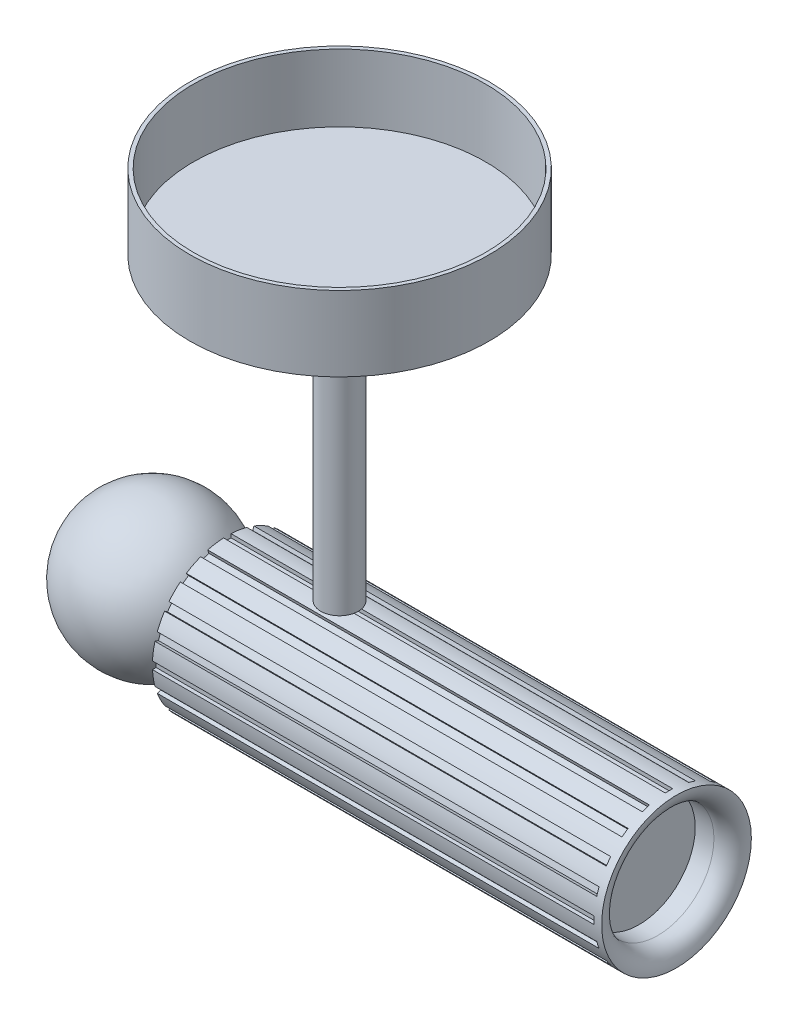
ISO-10303-21;
HEADER;
FILE_DESCRIPTION(('STEP AP214'),'2;1');
FILE_NAME('part.step','',(''),(''),'','','');
FILE_SCHEMA(('AUTOMOTIVE_DESIGN { 1 0 10303 214 1 1 1 1 }'));
ENDSEC;
DATA;
#1=APPLICATION_CONTEXT('core data for automotive mechanical design processes');
#2=APPLICATION_PROTOCOL_DEFINITION('international standard','automotive_design',2000,#1);
#3=PRODUCT_CONTEXT('',#1,'mechanical');
#4=PRODUCT('Part','Part','',(#3));
#5=PRODUCT_RELATED_PRODUCT_CATEGORY('part','',(#4));
#6=PRODUCT_DEFINITION_FORMATION('','',#4);
#7=PRODUCT_DEFINITION_CONTEXT('part definition',#1,'design');
#8=PRODUCT_DEFINITION('design','',#6,#7);
#9=PRODUCT_DEFINITION_SHAPE('','',#8);
#10=(LENGTH_UNIT() NAMED_UNIT(*) SI_UNIT(.MILLI.,.METRE.));
#11=(NAMED_UNIT(*) PLANE_ANGLE_UNIT() SI_UNIT($,.RADIAN.));
#12=(NAMED_UNIT(*) SI_UNIT($,.STERADIAN.) SOLID_ANGLE_UNIT());
#13=UNCERTAINTY_MEASURE_WITH_UNIT(LENGTH_MEASURE(1.E-05),#10,'distance_accuracy_value','');
#14=(GEOMETRIC_REPRESENTATION_CONTEXT(3) GLOBAL_UNCERTAINTY_ASSIGNED_CONTEXT((#13)) GLOBAL_UNIT_ASSIGNED_CONTEXT((#10,
#11,#12)) REPRESENTATION_CONTEXT('',''));
#15=CARTESIAN_POINT('',(0.,0.,0.));
#16=DIRECTION('',(0.,0.,1.));
#17=DIRECTION('',(1.,0.,0.));
#18=AXIS2_PLACEMENT_3D('',#15,#16,#17);
#19=CARTESIAN_POINT('',(-50.,-100.,0.));
#20=DIRECTION('',(0.,1.,0.));
#21=DIRECTION('',(1.,0.,0.));
#22=AXIS2_PLACEMENT_3D('',#19,#20,#21);
#23=SPHERICAL_SURFACE('',#22,20.);
#24=CARTESIAN_POINT('',(-50.,-80.,0.));
#25=VERTEX_POINT('',#24);
#26=VERTEX_LOOP('',#25);
#27=FACE_BOUND('',#26,.T.);
#28=ADVANCED_FACE('F131',(#27),#23,.T.);
#29=CLOSED_SHELL('',(#28));
#30=MANIFOLD_SOLID_BREP('B2',#29);
#31=CARTESIAN_POINT('',(-70.001,-9.85816727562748,-30.3403191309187));
#32=DIRECTION('',(0.,0.309016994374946,0.951056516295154));
#33=DIRECTION('',(0.,-0.951056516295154,0.309016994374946));
#34=AXIS2_PLACEMENT_3D('',#31,#32,#33);
#35=PLANE('',#34);
#36=DIRECTION('',(1.,0.,0.));
#37=VECTOR('',#36,1.);
#38=CARTESIAN_POINT('',(-70.001,-82.2421078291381,-6.82135115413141));
#39=LINE('',#38,#37);
#40=CARTESIAN_POINT('',(-30.,-82.2421078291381,-6.82135115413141));
#41=VERTEX_POINT('',#40);
#42=CARTESIAN_POINT('',(88.,-82.2421078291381,-6.82135115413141));
#43=VERTEX_POINT('',#42);
#44=EDGE_CURVE('E971',#41,#43,#39,.T.);
#45=ORIENTED_EDGE('',*,*,#44,.T.);
#46=DIRECTION('',(0.,0.951056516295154,-0.309016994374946));
#47=VECTOR('',#46,1.);
#48=CARTESIAN_POINT('',(88.,-9.85816727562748,-30.3403191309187));
#49=LINE('',#48,#47);
#50=CARTESIAN_POINT('',(88.,-81.3116779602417,-7.12366614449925));
#51=VERTEX_POINT('',#50);
#52=EDGE_CURVE('E177',#43,#51,#49,.T.);
#53=ORIENTED_EDGE('',*,*,#52,.T.);
#54=DIRECTION('',(1.,0.,0.));
#55=VECTOR('',#54,1.);
#56=CARTESIAN_POINT('',(-30.,-81.3116779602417,-7.12366614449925));
#57=LINE('',#56,#55);
#58=CARTESIAN_POINT('',(-30.,-81.3116779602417,-7.12366614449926));
#59=VERTEX_POINT('',#58);
#60=EDGE_CURVE('E981',#59,#51,#57,.T.);
#61=ORIENTED_EDGE('',*,*,#60,.F.);
#62=DIRECTION('',(0.,0.951056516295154,-0.309016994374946));
#63=VECTOR('',#62,1.);
#64=CARTESIAN_POINT('',(-30.,-9.85816727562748,-30.3403191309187));
#65=LINE('',#64,#63);
#66=EDGE_CURVE('E966',#41,#59,#65,.T.);
#67=ORIENTED_EDGE('',*,*,#66,.F.);
#68=EDGE_LOOP('',(#45,#53,#61,#67));
#69=FACE_BOUND('',#68,.T.);
#70=ADVANCED_FACE('F161',(#69),#35,.T.);
#71=CARTESIAN_POINT('',(-70.001,-9.24013328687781,-28.4382060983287));
#72=DIRECTION('',(0.,0.30901699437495,0.951056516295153));
#73=DIRECTION('',(0.,-0.951056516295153,0.30901699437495));
#74=AXIS2_PLACEMENT_3D('',#71,#72,#73);
#75=PLANE('',#74);
#76=DIRECTION('',(0.,0.951056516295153,-0.30901699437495));
#77=VECTOR('',#76,1.);
#78=CARTESIAN_POINT('',(88.,-9.24013328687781,-28.4382060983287));
#79=LINE('',#78,#77);
#80=CARTESIAN_POINT('',(88.,-81.6240738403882,-4.91923812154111));
#81=VERTEX_POINT('',#80);
#82=CARTESIAN_POINT('',(88.,-80.6936439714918,-5.22155311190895));
#83=VERTEX_POINT('',#82);
#84=EDGE_CURVE('E1319',#81,#83,#79,.T.);
#85=ORIENTED_EDGE('',*,*,#84,.F.);
#86=DIRECTION('',(1.,0.,0.));
#87=VECTOR('',#86,1.);
#88=CARTESIAN_POINT('',(-70.001,-81.6240738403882,-4.91923812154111));
#89=LINE('',#88,#87);
#90=CARTESIAN_POINT('',(-30.,-81.6240738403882,-4.91923812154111));
#91=VERTEX_POINT('',#90);
#92=EDGE_CURVE('E886',#91,#81,#89,.T.);
#93=ORIENTED_EDGE('',*,*,#92,.F.);
#94=DIRECTION('',(0.,0.951056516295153,-0.30901699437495));
#95=VECTOR('',#94,1.);
#96=CARTESIAN_POINT('',(-30.,-9.24013328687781,-28.4382060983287));
#97=LINE('',#96,#95);
#98=CARTESIAN_POINT('',(-30.,-80.6936439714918,-5.22155311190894));
#99=VERTEX_POINT('',#98);
#100=EDGE_CURVE('E963',#91,#99,#97,.T.);
#101=ORIENTED_EDGE('',*,*,#100,.T.);
#102=DIRECTION('',(1.,0.,0.));
#103=VECTOR('',#102,1.);
#104=CARTESIAN_POINT('',(-30.,-80.6936439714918,-5.22155311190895));
#105=LINE('',#104,#103);
#106=EDGE_CURVE('E185',#99,#83,#105,.T.);
#107=ORIENTED_EDGE('',*,*,#106,.T.);
#108=EDGE_LOOP('',(#85,#93,#101,#107));
#109=FACE_BOUND('',#108,.T.);
#110=ADVANCED_FACE('F1537',(#109),#75,.F.);
#111=CARTESIAN_POINT('',(-70.001,-81.6240738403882,-4.91923812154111));
#112=DIRECTION('',(0.,-0.951056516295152,0.309016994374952));
#113=DIRECTION('',(0.,-0.309016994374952,-0.951056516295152));
#114=AXIS2_PLACEMENT_3D('',#111,#112,#113);
#115=PLANE('',#114);
#116=DIRECTION('',(0.,0.309016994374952,0.951056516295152));
#117=VECTOR('',#116,1.);
#118=CARTESIAN_POINT('',(88.,-81.6240738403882,-4.91923812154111));
#119=LINE('',#118,#117);
#120=EDGE_CURVE('E1322',#43,#81,#119,.T.);
#121=ORIENTED_EDGE('',*,*,#120,.F.);
#122=ORIENTED_EDGE('',*,*,#44,.F.);
#123=DIRECTION('',(0.,0.309016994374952,0.951056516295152));
#124=VECTOR('',#123,1.);
#125=CARTESIAN_POINT('',(-30.,-81.6240738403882,-4.91923812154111));
#126=LINE('',#125,#124);
#127=EDGE_CURVE('E967',#41,#91,#126,.T.);
#128=ORIENTED_EDGE('',*,*,#127,.T.);
#129=ORIENTED_EDGE('',*,*,#92,.T.);
#130=EDGE_LOOP('',(#121,#122,#128,#129));
#131=FACE_BOUND('',#130,.T.);
#132=ADVANCED_FACE('F1542',(#131),#115,.F.);
#133=CARTESIAN_POINT('',(-70.001,-9.24013328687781,28.4382060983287));
#134=DIRECTION('',(0.,-0.30901699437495,0.951056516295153));
#135=DIRECTION('',(0.,-0.951056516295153,-0.30901699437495));
#136=AXIS2_PLACEMENT_3D('',#133,#134,#135);
#137=PLANE('',#136);
#138=DIRECTION('',(1.,0.,0.));
#139=VECTOR('',#138,1.);
#140=CARTESIAN_POINT('',(-70.001,-81.6240738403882,4.91923812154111));
#141=LINE('',#140,#139);
#142=CARTESIAN_POINT('',(-30.,-81.6240738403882,4.91923812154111));
#143=VERTEX_POINT('',#142);
#144=CARTESIAN_POINT('',(88.,-81.6240738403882,4.91923812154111));
#145=VERTEX_POINT('',#144);
#146=EDGE_CURVE('E1283',#143,#145,#141,.T.);
#147=ORIENTED_EDGE('',*,*,#146,.T.);
#148=DIRECTION('',(0.,0.951056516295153,0.30901699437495));
#149=VECTOR('',#148,1.);
#150=CARTESIAN_POINT('',(88.,-9.24013328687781,28.4382060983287));
#151=LINE('',#150,#149);
#152=CARTESIAN_POINT('',(88.,-80.6936439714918,5.22155311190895));
#153=VERTEX_POINT('',#152);
#154=EDGE_CURVE('E1326',#145,#153,#151,.T.);
#155=ORIENTED_EDGE('',*,*,#154,.T.);
#156=DIRECTION('',(1.,0.,0.));
#157=VECTOR('',#156,1.);
#158=CARTESIAN_POINT('',(-30.,-80.6936439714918,5.22155311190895));
#159=LINE('',#158,#157);
#160=CARTESIAN_POINT('',(-30.,-80.6936439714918,5.22155311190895));
#161=VERTEX_POINT('',#160);
#162=EDGE_CURVE('E987',#161,#153,#159,.T.);
#163=ORIENTED_EDGE('',*,*,#162,.F.);
#164=DIRECTION('',(0.,0.951056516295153,0.30901699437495));
#165=VECTOR('',#164,1.);
#166=CARTESIAN_POINT('',(-30.,-80.6666880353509,5.23031162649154));
#167=LINE('',#166,#165);
#168=EDGE_CURVE('E735',#143,#161,#167,.T.);
#169=ORIENTED_EDGE('',*,*,#168,.F.);
#170=EDGE_LOOP('',(#147,#155,#163,#169));
#171=FACE_BOUND('',#170,.T.);
#172=ADVANCED_FACE('F1548',(#171),#137,.T.);
#173=CARTESIAN_POINT('',(-70.001,-9.85816727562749,30.3403191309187));
#174=DIRECTION('',(0.,-0.309016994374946,0.951056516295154));
#175=DIRECTION('',(0.,-0.951056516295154,-0.309016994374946));
#176=AXIS2_PLACEMENT_3D('',#173,#174,#175);
#177=PLANE('',#176);
#178=DIRECTION('',(0.,0.951056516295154,0.309016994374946));
#179=VECTOR('',#178,1.);
#180=CARTESIAN_POINT('',(88.,-9.85816727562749,30.3403191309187));
#181=LINE('',#180,#179);
#182=CARTESIAN_POINT('',(88.,-82.2421078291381,6.82135115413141));
#183=VERTEX_POINT('',#182);
#184=CARTESIAN_POINT('',(88.,-81.3116779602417,7.12366614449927));
#185=VERTEX_POINT('',#184);
#186=EDGE_CURVE('E1329',#183,#185,#181,.T.);
#187=ORIENTED_EDGE('',*,*,#186,.F.);
#188=DIRECTION('',(1.,0.,0.));
#189=VECTOR('',#188,1.);
#190=CARTESIAN_POINT('',(-70.001,-82.2421078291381,6.82135115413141));
#191=LINE('',#190,#189);
#192=CARTESIAN_POINT('',(-30.,-82.2421078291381,6.82135115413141));
#193=VERTEX_POINT('',#192);
#194=EDGE_CURVE('E1282',#193,#183,#191,.T.);
#195=ORIENTED_EDGE('',*,*,#194,.F.);
#196=DIRECTION('',(0.,0.951056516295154,0.309016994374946));
#197=VECTOR('',#196,1.);
#198=CARTESIAN_POINT('',(-30.,-81.2847220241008,7.13242465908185));
#199=LINE('',#198,#197);
#200=CARTESIAN_POINT('',(-30.,-81.3116779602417,7.12366614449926));
#201=VERTEX_POINT('',#200);
#202=EDGE_CURVE('E1279',#193,#201,#199,.T.);
#203=ORIENTED_EDGE('',*,*,#202,.T.);
#204=DIRECTION('',(1.,0.,0.));
#205=VECTOR('',#204,1.);
#206=CARTESIAN_POINT('',(-30.,-81.3116779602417,7.12366614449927));
#207=LINE('',#206,#205);
#208=EDGE_CURVE('E984',#201,#185,#207,.T.);
#209=ORIENTED_EDGE('',*,*,#208,.T.);
#210=EDGE_LOOP('',(#187,#195,#203,#209));
#211=FACE_BOUND('',#210,.T.);
#212=ADVANCED_FACE('F1817',(#211),#177,.F.);
#213=CARTESIAN_POINT('',(-70.001,-82.2421078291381,6.82135115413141));
#214=DIRECTION('',(0.,-0.95105651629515,-0.309016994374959));
#215=DIRECTION('',(0.,0.309016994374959,-0.95105651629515));
#216=AXIS2_PLACEMENT_3D('',#213,#214,#215);
#217=PLANE('',#216);
#218=DIRECTION('',(0.,-0.309016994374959,0.95105651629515));
#219=VECTOR('',#218,1.);
#220=CARTESIAN_POINT('',(88.,-82.2421078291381,6.82135115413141));
#221=LINE('',#220,#219);
#222=EDGE_CURVE('E1333',#145,#183,#221,.T.);
#223=ORIENTED_EDGE('',*,*,#222,.F.);
#224=ORIENTED_EDGE('',*,*,#146,.F.);
#225=DIRECTION('',(0.,-0.309016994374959,0.95105651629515));
#226=VECTOR('',#225,1.);
#227=CARTESIAN_POINT('',(-30.,-82.2421078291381,6.82135115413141));
#228=LINE('',#227,#226);
#229=EDGE_CURVE('E1259',#143,#193,#228,.T.);
#230=ORIENTED_EDGE('',*,*,#229,.T.);
#231=ORIENTED_EDGE('',*,*,#194,.T.);
#232=EDGE_LOOP('',(#223,#224,#230,#231));
#233=FACE_BOUND('',#232,.T.);
#234=ADVANCED_FACE('F1822',(#233),#217,.F.);
#235=CARTESIAN_POINT('',(-70.001,-35.1369355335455,-48.3618428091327));
#236=DIRECTION('',(0.,0.587785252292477,0.809016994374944));
#237=DIRECTION('',(0.,-0.809016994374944,0.587785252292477));
#238=AXIS2_PLACEMENT_3D('',#235,#236,#237);
#239=PLANE('',#238);
#240=DIRECTION('',(1.,0.,0.));
#241=VECTOR('',#240,1.);
#242=CARTESIAN_POINT('',(-70.001,-85.2191543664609,-11.9749809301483));
#243=LINE('',#242,#241);
#244=CARTESIAN_POINT('',(-30.,-85.2191543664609,-11.9749809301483));
#245=VERTEX_POINT('',#244);
#246=CARTESIAN_POINT('',(88.,-85.2191543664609,-11.9749809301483));
#247=VERTEX_POINT('',#246);
#248=EDGE_CURVE('E1268',#245,#247,#243,.T.);
#249=ORIENTED_EDGE('',*,*,#248,.T.);
#250=DIRECTION('',(0.,0.809016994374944,-0.587785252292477));
#251=VECTOR('',#250,1.);
#252=CARTESIAN_POINT('',(88.,-35.1369355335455,-48.3618428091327));
#253=LINE('',#252,#251);
#254=CARTESIAN_POINT('',(88.,-84.4276834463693,-12.5500182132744));
#255=VERTEX_POINT('',#254);
#256=EDGE_CURVE('E1337',#247,#255,#253,.T.);
#257=ORIENTED_EDGE('',*,*,#256,.T.);
#258=DIRECTION('',(1.,0.,0.));
#259=VECTOR('',#258,1.);
#260=CARTESIAN_POINT('',(-30.,-84.4276834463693,-12.5500182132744));
#261=LINE('',#260,#259);
#262=CARTESIAN_POINT('',(-30.,-84.4276834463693,-12.5500182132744));
#263=VERTEX_POINT('',#262);
#264=EDGE_CURVE('E994',#263,#255,#261,.T.);
#265=ORIENTED_EDGE('',*,*,#264,.F.);
#266=DIRECTION('',(0.,0.809016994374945,-0.587785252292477));
#267=VECTOR('',#266,1.);
#268=CARTESIAN_POINT('',(-30.,-84.4047533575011,-12.5666778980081));
#269=LINE('',#268,#267);
#270=EDGE_CURVE('E1260',#245,#263,#269,.T.);
#271=ORIENTED_EDGE('',*,*,#270,.F.);
#272=EDGE_LOOP('',(#249,#257,#265,#271));
#273=FACE_BOUND('',#272,.T.);
#274=ADVANCED_FACE('F2094',(#273),#239,.T.);
#275=CARTESIAN_POINT('',(-70.001,-33.9613650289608,-46.7438088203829));
#276=DIRECTION('',(0.,0.587785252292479,0.809016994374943));
#277=DIRECTION('',(0.,-0.809016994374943,0.587785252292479));
#278=AXIS2_PLACEMENT_3D('',#275,#276,#277);
#279=PLANE('',#278);
#280=DIRECTION('',(0.,0.809016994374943,-0.587785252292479));
#281=VECTOR('',#280,1.);
#282=CARTESIAN_POINT('',(88.,-33.9613650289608,-46.7438088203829));
#283=LINE('',#282,#281);
#284=CARTESIAN_POINT('',(88.,-84.0435838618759,-10.3569469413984));
#285=VERTEX_POINT('',#284);
#286=CARTESIAN_POINT('',(88.,-83.2521129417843,-10.9319842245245));
#287=VERTEX_POINT('',#286);
#288=EDGE_CURVE('E1340',#285,#287,#283,.T.);
#289=ORIENTED_EDGE('',*,*,#288,.F.);
#290=DIRECTION('',(1.,0.,0.));
#291=VECTOR('',#290,1.);
#292=CARTESIAN_POINT('',(-70.001,-84.0435838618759,-10.3569469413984));
#293=LINE('',#292,#291);
#294=CARTESIAN_POINT('',(-30.,-84.0435838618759,-10.3569469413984));
#295=VERTEX_POINT('',#294);
#296=EDGE_CURVE('E1264',#295,#285,#293,.T.);
#297=ORIENTED_EDGE('',*,*,#296,.F.);
#298=DIRECTION('',(0.,0.809016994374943,-0.587785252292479));
#299=VECTOR('',#298,1.);
#300=CARTESIAN_POINT('',(-30.,-83.2291828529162,-10.9486439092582));
#301=LINE('',#300,#299);
#302=CARTESIAN_POINT('',(-30.,-83.2521129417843,-10.9319842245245));
#303=VERTEX_POINT('',#302);
#304=EDGE_CURVE('E1272',#295,#303,#301,.T.);
#305=ORIENTED_EDGE('',*,*,#304,.T.);
#306=DIRECTION('',(1.,0.,0.));
#307=VECTOR('',#306,1.);
#308=CARTESIAN_POINT('',(-30.,-83.2521129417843,-10.9319842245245));
#309=LINE('',#308,#307);
#310=EDGE_CURVE('E991',#303,#287,#309,.T.);
#311=ORIENTED_EDGE('',*,*,#310,.T.);
#312=EDGE_LOOP('',(#289,#297,#305,#311));
#313=FACE_BOUND('',#312,.T.);
#314=ADVANCED_FACE('F2104',(#313),#279,.F.);
#315=CARTESIAN_POINT('',(-70.001,-84.0435838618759,-10.3569469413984));
#316=DIRECTION('',(0.,-0.809016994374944,0.587785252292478));
#317=DIRECTION('',(0.,-0.587785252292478,-0.809016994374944));
#318=AXIS2_PLACEMENT_3D('',#315,#316,#317);
#319=PLANE('',#318);
#320=DIRECTION('',(0.,0.587785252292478,0.809016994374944));
#321=VECTOR('',#320,1.);
#322=CARTESIAN_POINT('',(88.,-84.0435838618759,-10.3569469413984));
#323=LINE('',#322,#321);
#324=EDGE_CURVE('E1344',#247,#285,#323,.T.);
#325=ORIENTED_EDGE('',*,*,#324,.F.);
#326=ORIENTED_EDGE('',*,*,#248,.F.);
#327=DIRECTION('',(0.,0.587785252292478,0.809016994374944));
#328=VECTOR('',#327,1.);
#329=CARTESIAN_POINT('',(-30.,-84.0435838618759,-10.3569469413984));
#330=LINE('',#329,#328);
#331=EDGE_CURVE('E1255',#245,#295,#330,.T.);
#332=ORIENTED_EDGE('',*,*,#331,.T.);
#333=ORIENTED_EDGE('',*,*,#296,.T.);
#334=EDGE_LOOP('',(#325,#326,#332,#333));
#335=FACE_BOUND('',#334,.T.);
#336=ADVANCED_FACE('F2116',(#335),#319,.F.);
#337=CARTESIAN_POINT('',(-70.001,-81.0033275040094,1.00000000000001));
#338=DIRECTION('',(0.,-1.,0.));
#339=DIRECTION('',(0.,0.,-1.));
#340=AXIS2_PLACEMENT_3D('',#337,#338,#339);
#341=PLANE('',#340);
#342=DIRECTION('',(0.,0.,1.));
#343=VECTOR('',#342,1.);
#344=CARTESIAN_POINT('',(88.,-81.0033275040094,1.00000000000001));
#345=LINE('',#344,#343);
#346=CARTESIAN_POINT('',(88.,-81.0033275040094,-0.999999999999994));
#347=VERTEX_POINT('',#346);
#348=CARTESIAN_POINT('',(88.,-81.0033275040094,1.00000000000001));
#349=VERTEX_POINT('',#348);
#350=EDGE_CURVE('E1351',#347,#349,#345,.T.);
#351=ORIENTED_EDGE('',*,*,#350,.F.);
#352=DIRECTION('',(1.,0.,0.));
#353=VECTOR('',#352,1.);
#354=CARTESIAN_POINT('',(-70.001,-81.0033275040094,-0.999999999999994));
#355=LINE('',#354,#353);
#356=CARTESIAN_POINT('',(-30.,-81.0033275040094,-0.999999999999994));
#357=VERTEX_POINT('',#356);
#358=EDGE_CURVE('E1305',#357,#347,#355,.T.);
#359=ORIENTED_EDGE('',*,*,#358,.F.);
#360=DIRECTION('',(0.,0.,1.));
#361=VECTOR('',#360,1.);
#362=CARTESIAN_POINT('',(-30.,-81.0033275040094,1.00000000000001));
#363=LINE('',#362,#361);
#364=CARTESIAN_POINT('',(-30.,-81.0033275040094,1.00000000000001));
#365=VERTEX_POINT('',#364);
#366=EDGE_CURVE('E1297',#357,#365,#363,.T.);
#367=ORIENTED_EDGE('',*,*,#366,.T.);
#368=DIRECTION('',(1.,0.,0.));
#369=VECTOR('',#368,1.);
#370=CARTESIAN_POINT('',(-70.001,-81.0033275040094,1.00000000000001));
#371=LINE('',#370,#369);
#372=EDGE_CURVE('E1306',#365,#349,#371,.T.);
#373=ORIENTED_EDGE('',*,*,#372,.T.);
#374=EDGE_LOOP('',(#351,#359,#367,#373));
#375=FACE_BOUND('',#374,.T.);
#376=ADVANCED_FACE('F1833',(#375),#341,.F.);
#377=CARTESIAN_POINT('',(-70.001,-79.9966724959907,1.00000000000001));
#378=DIRECTION('',(0.,0.,1.));
#379=DIRECTION('',(1.,0.,0.));
#380=AXIS2_PLACEMENT_3D('',#377,#378,#379);
#381=PLANE('',#380);
#382=DIRECTION('',(0.,1.,0.));
#383=VECTOR('',#382,1.);
#384=CARTESIAN_POINT('',(88.,-79.9966724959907,1.00000000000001));
#385=LINE('',#384,#383);
#386=CARTESIAN_POINT('',(88.,-80.0250156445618,1.00000000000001));
#387=VERTEX_POINT('',#386);
#388=EDGE_CURVE('E1348',#349,#387,#385,.T.);
#389=ORIENTED_EDGE('',*,*,#388,.F.);
#390=ORIENTED_EDGE('',*,*,#372,.F.);
#391=DIRECTION('',(0.,1.,0.));
#392=VECTOR('',#391,1.);
#393=CARTESIAN_POINT('',(-30.,-79.9966724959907,1.00000000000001));
#394=LINE('',#393,#392);
#395=CARTESIAN_POINT('',(-30.,-80.0250156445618,1.00000000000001));
#396=VERTEX_POINT('',#395);
#397=EDGE_CURVE('E1301',#365,#396,#394,.T.);
#398=ORIENTED_EDGE('',*,*,#397,.T.);
#399=DIRECTION('',(1.,0.,0.));
#400=VECTOR('',#399,1.);
#401=CARTESIAN_POINT('',(-30.,-80.0250156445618,1.00000000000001));
#402=LINE('',#401,#400);
#403=EDGE_CURVE('E1294',#387,#396,#402,.F.);
#404=ORIENTED_EDGE('',*,*,#403,.F.);
#405=EDGE_LOOP('',(#389,#390,#398,#404));
#406=FACE_BOUND('',#405,.T.);
#407=ADVANCED_FACE('F1830',(#406),#381,.F.);
#408=CARTESIAN_POINT('',(-70.001,-79.9966724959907,-0.999999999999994));
#409=DIRECTION('',(0.,0.,1.));
#410=DIRECTION('',(1.,0.,0.));
#411=AXIS2_PLACEMENT_3D('',#408,#409,#410);
#412=PLANE('',#411);
#413=ORIENTED_EDGE('',*,*,#358,.T.);
#414=DIRECTION('',(0.,1.,0.));
#415=VECTOR('',#414,1.);
#416=CARTESIAN_POINT('',(88.,-79.9966724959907,-0.999999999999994));
#417=LINE('',#416,#415);
#418=CARTESIAN_POINT('',(88.,-80.0250156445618,-0.999999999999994));
#419=VERTEX_POINT('',#418);
#420=EDGE_CURVE('E1354',#347,#419,#417,.T.);
#421=ORIENTED_EDGE('',*,*,#420,.T.);
#422=DIRECTION('',(1.,0.,0.));
#423=VECTOR('',#422,1.);
#424=CARTESIAN_POINT('',(-30.,-80.0250156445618,-0.999999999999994));
#425=LINE('',#424,#423);
#426=CARTESIAN_POINT('',(-30.,-80.0250156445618,-0.999999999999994));
#427=VERTEX_POINT('',#426);
#428=EDGE_CURVE('E1275',#419,#427,#425,.F.);
#429=ORIENTED_EDGE('',*,*,#428,.T.);
#430=DIRECTION('',(0.,1.,0.));
#431=VECTOR('',#430,1.);
#432=CARTESIAN_POINT('',(-30.,-79.9966724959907,-0.999999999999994));
#433=LINE('',#432,#431);
#434=EDGE_CURVE('E1310',#357,#427,#433,.T.);
#435=ORIENTED_EDGE('',*,*,#434,.F.);
#436=EDGE_LOOP('',(#413,#421,#429,#435));
#437=FACE_BOUND('',#436,.T.);
#438=ADVANCED_FACE('F1611',(#437),#412,.T.);
#439=CARTESIAN_POINT('',(-70.001,-111.974980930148,14.7808456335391));
#440=DIRECTION('',(0.,0.587785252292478,-0.809016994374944));
#441=DIRECTION('',(0.,0.809016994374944,0.587785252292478));
#442=AXIS2_PLACEMENT_3D('',#439,#440,#441);
#443=PLANE('',#442);
#444=DIRECTION('',(0.,-0.809016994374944,-0.587785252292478));
#445=VECTOR('',#444,1.);
#446=CARTESIAN_POINT('',(88.,-111.974980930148,14.7808456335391));
#447=LINE('',#446,#445);
#448=CARTESIAN_POINT('',(88.,-110.356946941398,15.9564161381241));
#449=VERTEX_POINT('',#448);
#450=CARTESIAN_POINT('',(88.,-111.974980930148,14.7808456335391));
#451=VERTEX_POINT('',#450);
#452=EDGE_CURVE('E1361',#449,#451,#447,.T.);
#453=ORIENTED_EDGE('',*,*,#452,.F.);
#454=DIRECTION('',(1.,0.,0.));
#455=VECTOR('',#454,1.);
#456=CARTESIAN_POINT('',(-70.001,-110.356946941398,15.9564161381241));
#457=LINE('',#456,#455);
#458=CARTESIAN_POINT('',(-30.,-110.356946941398,15.9564161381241));
#459=VERTEX_POINT('',#458);
#460=EDGE_CURVE('E837',#459,#449,#457,.T.);
#461=ORIENTED_EDGE('',*,*,#460,.F.);
#462=DIRECTION('',(0.,-0.809016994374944,-0.587785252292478));
#463=VECTOR('',#462,1.);
#464=CARTESIAN_POINT('',(-30.,-111.974980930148,14.7808456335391));
#465=LINE('',#464,#463);
#466=CARTESIAN_POINT('',(-30.,-111.974980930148,14.7808456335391));
#467=VERTEX_POINT('',#466);
#468=EDGE_CURVE('E834',#459,#467,#465,.T.);
#469=ORIENTED_EDGE('',*,*,#468,.T.);
#470=DIRECTION('',(1.,0.,0.));
#471=VECTOR('',#470,1.);
#472=CARTESIAN_POINT('',(-70.001,-111.974980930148,14.7808456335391));
#473=LINE('',#472,#471);
#474=EDGE_CURVE('E839',#467,#451,#473,.T.);
#475=ORIENTED_EDGE('',*,*,#474,.T.);
#476=EDGE_LOOP('',(#453,#461,#469,#475));
#477=FACE_BOUND('',#476,.T.);
#478=ADVANCED_FACE('F1607',(#477),#443,.F.);
#479=CARTESIAN_POINT('',(-70.001,-112.566677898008,15.5952466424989));
#480=DIRECTION('',(0.,-0.809016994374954,-0.587785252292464));
#481=DIRECTION('',(0.,0.587785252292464,-0.809016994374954));
#482=AXIS2_PLACEMENT_3D('',#479,#480,#481);
#483=PLANE('',#482);
#484=DIRECTION('',(0.,-0.587785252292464,0.809016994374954));
#485=VECTOR('',#484,1.);
#486=CARTESIAN_POINT('',(88.,-112.566677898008,15.5952466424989));
#487=LINE('',#486,#485);
#488=CARTESIAN_POINT('',(88.,-112.550018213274,15.5723165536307));
#489=VERTEX_POINT('',#488);
#490=EDGE_CURVE('E1358',#451,#489,#487,.T.);
#491=ORIENTED_EDGE('',*,*,#490,.F.);
#492=ORIENTED_EDGE('',*,*,#474,.F.);
#493=DIRECTION('',(0.,-0.587785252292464,0.809016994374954));
#494=VECTOR('',#493,1.);
#495=CARTESIAN_POINT('',(-30.,-112.566677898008,15.5952466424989));
#496=LINE('',#495,#494);
#497=CARTESIAN_POINT('',(-30.,-112.550018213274,15.5723165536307));
#498=VERTEX_POINT('',#497);
#499=EDGE_CURVE('E843',#467,#498,#496,.T.);
#500=ORIENTED_EDGE('',*,*,#499,.T.);
#501=DIRECTION('',(1.,0.,0.));
#502=VECTOR('',#501,1.);
#503=CARTESIAN_POINT('',(-30.,-112.550018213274,15.5723165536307));
#504=LINE('',#503,#502);
#505=EDGE_CURVE('E854',#489,#498,#504,.F.);
#506=ORIENTED_EDGE('',*,*,#505,.F.);
#507=EDGE_LOOP('',(#491,#492,#500,#506));
#508=FACE_BOUND('',#507,.T.);
#509=ADVANCED_FACE('F1604',(#508),#483,.F.);
#510=CARTESIAN_POINT('',(-70.001,-110.948643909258,16.7708171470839));
#511=DIRECTION('',(0.,-0.80901699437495,-0.58778525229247));
#512=DIRECTION('',(0.,0.58778525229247,-0.80901699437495));
#513=AXIS2_PLACEMENT_3D('',#510,#511,#512);
#514=PLANE('',#513);
#515=ORIENTED_EDGE('',*,*,#460,.T.);
#516=DIRECTION('',(0.,-0.58778525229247,0.80901699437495));
#517=VECTOR('',#516,1.);
#518=CARTESIAN_POINT('',(88.,-110.948643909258,16.7708171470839));
#519=LINE('',#518,#517);
#520=CARTESIAN_POINT('',(88.,-110.931984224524,16.7478870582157));
#521=VERTEX_POINT('',#520);
#522=EDGE_CURVE('E1364',#449,#521,#519,.T.);
#523=ORIENTED_EDGE('',*,*,#522,.T.);
#524=DIRECTION('',(1.,0.,0.));
#525=VECTOR('',#524,1.);
#526=CARTESIAN_POINT('',(-30.,-110.931984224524,16.7478870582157));
#527=LINE('',#526,#525);
#528=CARTESIAN_POINT('',(-30.,-110.931984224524,16.7478870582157));
#529=VERTEX_POINT('',#528);
#530=EDGE_CURVE('E813',#521,#529,#527,.F.);
#531=ORIENTED_EDGE('',*,*,#530,.T.);
#532=DIRECTION('',(0.,-0.58778525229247,0.80901699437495));
#533=VECTOR('',#532,1.);
#534=CARTESIAN_POINT('',(-30.,-110.948643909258,16.7708171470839));
#535=LINE('',#534,#533);
#536=EDGE_CURVE('E850',#459,#529,#535,.T.);
#537=ORIENTED_EDGE('',*,*,#536,.F.);
#538=EDGE_LOOP('',(#515,#523,#531,#537));
#539=FACE_BOUND('',#538,.T.);
#540=ADVANCED_FACE('F1599',(#539),#514,.T.);
#541=CARTESIAN_POINT('',(-70.001,-101.,18.9966724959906));
#542=DIRECTION('',(0.,0.,-1.));
#543=DIRECTION('',(-1.,0.,0.));
#544=AXIS2_PLACEMENT_3D('',#541,#542,#543);
#545=PLANE('',#544);
#546=DIRECTION('',(0.,-1.,0.));
#547=VECTOR('',#546,1.);
#548=CARTESIAN_POINT('',(88.,-101.,18.9966724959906));
#549=LINE('',#548,#547);
#550=CARTESIAN_POINT('',(88.,-99.,18.9966724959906));
#551=VERTEX_POINT('',#550);
#552=CARTESIAN_POINT('',(88.,-101.,18.9966724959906));
#553=VERTEX_POINT('',#552);
#554=EDGE_CURVE('E1371',#551,#553,#549,.T.);
#555=ORIENTED_EDGE('',*,*,#554,.F.);
#556=DIRECTION('',(1.,0.,0.));
#557=VECTOR('',#556,1.);
#558=CARTESIAN_POINT('',(-70.001,-99.,18.9966724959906));
#559=LINE('',#558,#557);
#560=CARTESIAN_POINT('',(-30.,-99.,18.9966724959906));
#561=VERTEX_POINT('',#560);
#562=EDGE_CURVE('E812',#561,#551,#559,.T.);
#563=ORIENTED_EDGE('',*,*,#562,.F.);
#564=DIRECTION('',(0.,-1.,0.));
#565=VECTOR('',#564,1.);
#566=CARTESIAN_POINT('',(-30.,-101.,18.9966724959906));
#567=LINE('',#566,#565);
#568=CARTESIAN_POINT('',(-30.,-101.,18.9966724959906));
#569=VERTEX_POINT('',#568);
#570=EDGE_CURVE('E809',#561,#569,#567,.T.);
#571=ORIENTED_EDGE('',*,*,#570,.T.);
#572=DIRECTION('',(1.,0.,0.));
#573=VECTOR('',#572,1.);
#574=CARTESIAN_POINT('',(-70.001,-101.,18.9966724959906));
#575=LINE('',#574,#573);
#576=EDGE_CURVE('E814',#569,#553,#575,.T.);
#577=ORIENTED_EDGE('',*,*,#576,.T.);
#578=EDGE_LOOP('',(#555,#563,#571,#577));
#579=FACE_BOUND('',#578,.T.);
#580=ADVANCED_FACE('F1595',(#579),#545,.F.);
#581=CARTESIAN_POINT('',(-70.001,-101.,20.0033275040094));
#582=DIRECTION('',(0.,-1.,0.));
#583=DIRECTION('',(0.,0.,-1.));
#584=AXIS2_PLACEMENT_3D('',#581,#582,#583);
#585=PLANE('',#584);
#586=DIRECTION('',(0.,0.,1.));
#587=VECTOR('',#586,1.);
#588=CARTESIAN_POINT('',(88.,-101.,20.0033275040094));
#589=LINE('',#588,#587);
#590=CARTESIAN_POINT('',(88.,-101.,19.9749843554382));
#591=VERTEX_POINT('',#590);
#592=EDGE_CURVE('E1368',#553,#591,#589,.T.);
#593=ORIENTED_EDGE('',*,*,#592,.F.);
#594=ORIENTED_EDGE('',*,*,#576,.F.);
#595=DIRECTION('',(0.,0.,1.));
#596=VECTOR('',#595,1.);
#597=CARTESIAN_POINT('',(-30.,-101.,20.0033275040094));
#598=LINE('',#597,#596);
#599=CARTESIAN_POINT('',(-30.,-101.,19.9749843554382));
#600=VERTEX_POINT('',#599);
#601=EDGE_CURVE('E818',#569,#600,#598,.T.);
#602=ORIENTED_EDGE('',*,*,#601,.T.);
#603=DIRECTION('',(1.,0.,0.));
#604=VECTOR('',#603,1.);
#605=CARTESIAN_POINT('',(-30.,-101.,19.9749843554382));
#606=LINE('',#605,#604);
#607=EDGE_CURVE('E829',#591,#600,#606,.F.);
#608=ORIENTED_EDGE('',*,*,#607,.F.);
#609=EDGE_LOOP('',(#593,#594,#602,#608));
#610=FACE_BOUND('',#609,.T.);
#611=ADVANCED_FACE('F1592',(#610),#585,.F.);
#612=CARTESIAN_POINT('',(-70.001,-99.,20.0033275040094));
#613=DIRECTION('',(0.,-1.,0.));
#614=DIRECTION('',(0.,0.,-1.));
#615=AXIS2_PLACEMENT_3D('',#612,#613,#614);
#616=PLANE('',#615);
#617=ORIENTED_EDGE('',*,*,#562,.T.);
#618=DIRECTION('',(0.,0.,1.));
#619=VECTOR('',#618,1.);
#620=CARTESIAN_POINT('',(88.,-99.,20.0033275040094));
#621=LINE('',#620,#619);
#622=CARTESIAN_POINT('',(88.,-99.,19.9749843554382));
#623=VERTEX_POINT('',#622);
#624=EDGE_CURVE('E1374',#551,#623,#621,.T.);
#625=ORIENTED_EDGE('',*,*,#624,.T.);
#626=DIRECTION('',(1.,0.,0.));
#627=VECTOR('',#626,1.);
#628=CARTESIAN_POINT('',(-30.,-99.,19.9749843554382));
#629=LINE('',#628,#627);
#630=CARTESIAN_POINT('',(-30.,-99.,19.9749843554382));
#631=VERTEX_POINT('',#630);
#632=EDGE_CURVE('E788',#623,#631,#629,.F.);
#633=ORIENTED_EDGE('',*,*,#632,.T.);
#634=DIRECTION('',(0.,0.,1.));
#635=VECTOR('',#634,1.);
#636=CARTESIAN_POINT('',(-30.,-99.,20.0033275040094));
#637=LINE('',#636,#635);
#638=EDGE_CURVE('E825',#561,#631,#637,.T.);
#639=ORIENTED_EDGE('',*,*,#638,.F.);
#640=EDGE_LOOP('',(#617,#625,#633,#639));
#641=FACE_BOUND('',#640,.T.);
#642=ADVANCED_FACE('F1587',(#641),#616,.T.);
#643=CARTESIAN_POINT('',(-70.001,-95.0807618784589,18.3759261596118));
#644=DIRECTION('',(0.,-0.309016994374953,-0.951056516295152));
#645=DIRECTION('',(0.,0.951056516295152,-0.309016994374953));
#646=AXIS2_PLACEMENT_3D('',#643,#644,#645);
#647=PLANE('',#646);
#648=DIRECTION('',(0.,-0.951056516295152,0.309016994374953));
#649=VECTOR('',#648,1.);
#650=CARTESIAN_POINT('',(88.,-95.0807618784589,18.3759261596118));
#651=LINE('',#650,#649);
#652=CARTESIAN_POINT('',(88.,-93.1786488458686,17.7578921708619));
#653=VERTEX_POINT('',#652);
#654=CARTESIAN_POINT('',(88.,-95.0807618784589,18.3759261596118));
#655=VERTEX_POINT('',#654);
#656=EDGE_CURVE('E1381',#653,#655,#651,.T.);
#657=ORIENTED_EDGE('',*,*,#656,.F.);
#658=DIRECTION('',(1.,0.,0.));
#659=VECTOR('',#658,1.);
#660=CARTESIAN_POINT('',(-70.001,-93.1786488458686,17.7578921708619));
#661=LINE('',#660,#659);
#662=CARTESIAN_POINT('',(-30.,-93.1786488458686,17.7578921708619));
#663=VERTEX_POINT('',#662);
#664=EDGE_CURVE('E787',#663,#653,#661,.T.);
#665=ORIENTED_EDGE('',*,*,#664,.F.);
#666=DIRECTION('',(0.,-0.951056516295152,0.309016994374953));
#667=VECTOR('',#666,1.);
#668=CARTESIAN_POINT('',(-30.,-95.0807618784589,18.3759261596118));
#669=LINE('',#668,#667);
#670=CARTESIAN_POINT('',(-30.,-95.0807618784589,18.3759261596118));
#671=VERTEX_POINT('',#670);
#672=EDGE_CURVE('E800',#663,#671,#669,.T.);
#673=ORIENTED_EDGE('',*,*,#672,.T.);
#674=DIRECTION('',(1.,0.,0.));
#675=VECTOR('',#674,1.);
#676=CARTESIAN_POINT('',(-70.001,-95.0807618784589,18.3759261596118));
#677=LINE('',#676,#675);
#678=EDGE_CURVE('E792',#671,#655,#677,.T.);
#679=ORIENTED_EDGE('',*,*,#678,.T.);
#680=EDGE_LOOP('',(#657,#665,#673,#679));
#681=FACE_BOUND('',#680,.T.);
#682=ADVANCED_FACE('F1583',(#681),#647,.F.);
#683=CARTESIAN_POINT('',(-70.001,-92.8675753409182,18.7152779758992));
#684=DIRECTION('',(0.,-0.951056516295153,0.309016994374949));
#685=DIRECTION('',(0.,-0.309016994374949,-0.951056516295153));
#686=AXIS2_PLACEMENT_3D('',#683,#684,#685);
#687=PLANE('',#686);
#688=ORIENTED_EDGE('',*,*,#664,.T.);
#689=DIRECTION('',(0.,0.309016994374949,0.951056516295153));
#690=VECTOR('',#689,1.);
#691=CARTESIAN_POINT('',(88.,-92.8675753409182,18.7152779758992));
#692=LINE('',#691,#690);
#693=CARTESIAN_POINT('',(88.,-92.8763338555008,18.6883220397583));
#694=VERTEX_POINT('',#693);
#695=EDGE_CURVE('E1378',#653,#694,#692,.T.);
#696=ORIENTED_EDGE('',*,*,#695,.T.);
#697=DIRECTION('',(1.,0.,0.));
#698=VECTOR('',#697,1.);
#699=CARTESIAN_POINT('',(-30.,-92.8763338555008,18.6883220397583));
#700=LINE('',#699,#698);
#701=CARTESIAN_POINT('',(-30.,-92.8763338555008,18.6883220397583));
#702=VERTEX_POINT('',#701);
#703=EDGE_CURVE('E804',#694,#702,#700,.F.);
#704=ORIENTED_EDGE('',*,*,#703,.T.);
#705=DIRECTION('',(0.,0.309016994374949,0.951056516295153));
#706=VECTOR('',#705,1.);
#707=CARTESIAN_POINT('',(-30.,-92.8675753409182,18.7152779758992));
#708=LINE('',#707,#706);
#709=EDGE_CURVE('E796',#663,#702,#708,.T.);
#710=ORIENTED_EDGE('',*,*,#709,.F.);
#711=EDGE_LOOP('',(#688,#696,#704,#710));
#712=FACE_BOUND('',#711,.T.);
#713=ADVANCED_FACE('F1580',(#712),#687,.T.);
#714=CARTESIAN_POINT('',(-70.001,-94.7696883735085,19.3333119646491));
#715=DIRECTION('',(0.,-0.951056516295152,0.309016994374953));
#716=DIRECTION('',(0.,-0.309016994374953,-0.951056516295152));
#717=AXIS2_PLACEMENT_3D('',#714,#715,#716);
#718=PLANE('',#717);
#719=DIRECTION('',(0.,0.309016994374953,0.951056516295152));
#720=VECTOR('',#719,1.);
#721=CARTESIAN_POINT('',(88.,-94.7696883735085,19.3333119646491));
#722=LINE('',#721,#720);
#723=CARTESIAN_POINT('',(88.,-94.7784468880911,19.3063560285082));
#724=VERTEX_POINT('',#723);
#725=EDGE_CURVE('E1385',#655,#724,#722,.T.);
#726=ORIENTED_EDGE('',*,*,#725,.F.);
#727=ORIENTED_EDGE('',*,*,#678,.F.);
#728=DIRECTION('',(0.,0.309016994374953,0.951056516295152));
#729=VECTOR('',#728,1.);
#730=CARTESIAN_POINT('',(-30.,-94.7696883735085,19.3333119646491));
#731=LINE('',#730,#729);
#732=CARTESIAN_POINT('',(-30.,-94.7784468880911,19.3063560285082));
#733=VERTEX_POINT('',#732);
#734=EDGE_CURVE('E783',#671,#733,#731,.T.);
#735=ORIENTED_EDGE('',*,*,#734,.T.);
#736=DIRECTION('',(1.,0.,0.));
#737=VECTOR('',#736,1.);
#738=CARTESIAN_POINT('',(-30.,-94.7784468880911,19.3063560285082));
#739=LINE('',#738,#737);
#740=EDGE_CURVE('E760',#724,#733,#739,.F.);
#741=ORIENTED_EDGE('',*,*,#740,.F.);
#742=EDGE_LOOP('',(#726,#727,#735,#741));
#743=FACE_BOUND('',#742,.T.);
#744=ADVANCED_FACE('F1574',(#743),#718,.F.);
#745=CARTESIAN_POINT('',(-70.001,-89.6430530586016,15.956416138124));
#746=DIRECTION('',(0.,-0.587785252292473,-0.809016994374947));
#747=DIRECTION('',(0.,0.809016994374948,-0.587785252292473));
#748=AXIS2_PLACEMENT_3D('',#745,#746,#747);
#749=PLANE('',#748);
#750=DIRECTION('',(0.,-0.809016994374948,0.587785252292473));
#751=VECTOR('',#750,1.);
#752=CARTESIAN_POINT('',(88.,-89.6430530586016,15.956416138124));
#753=LINE('',#752,#751);
#754=CARTESIAN_POINT('',(88.,-88.0250190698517,14.7808456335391));
#755=VERTEX_POINT('',#754);
#756=CARTESIAN_POINT('',(88.,-89.6430530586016,15.956416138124));
#757=VERTEX_POINT('',#756);
#758=EDGE_CURVE('E1392',#755,#757,#753,.T.);
#759=ORIENTED_EDGE('',*,*,#758,.F.);
#760=DIRECTION('',(1.,0.,0.));
#761=VECTOR('',#760,1.);
#762=CARTESIAN_POINT('',(-70.001,-88.0250190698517,14.7808456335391));
#763=LINE('',#762,#761);
#764=CARTESIAN_POINT('',(-30.,-88.0250190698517,14.7808456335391));
#765=VERTEX_POINT('',#764);
#766=EDGE_CURVE('E759',#765,#755,#763,.T.);
#767=ORIENTED_EDGE('',*,*,#766,.F.);
#768=DIRECTION('',(0.,-0.809016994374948,0.587785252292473));
#769=VECTOR('',#768,1.);
#770=CARTESIAN_POINT('',(-30.,-89.6430530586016,15.956416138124));
#771=LINE('',#770,#769);
#772=CARTESIAN_POINT('',(-30.,-89.6430530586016,15.956416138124));
#773=VERTEX_POINT('',#772);
#774=EDGE_CURVE('E756',#765,#773,#771,.T.);
#775=ORIENTED_EDGE('',*,*,#774,.T.);
#776=DIRECTION('',(1.,0.,0.));
#777=VECTOR('',#776,1.);
#778=CARTESIAN_POINT('',(-70.001,-89.6430530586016,15.956416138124));
#779=LINE('',#778,#777);
#780=EDGE_CURVE('E761',#773,#757,#779,.T.);
#781=ORIENTED_EDGE('',*,*,#780,.T.);
#782=EDGE_LOOP('',(#759,#767,#775,#781));
#783=FACE_BOUND('',#782,.T.);
#784=ADVANCED_FACE('F1570',(#783),#749,.F.);
#785=CARTESIAN_POINT('',(-70.001,-89.0513560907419,16.7708171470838));
#786=DIRECTION('',(0.,-0.809016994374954,0.587785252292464));
#787=DIRECTION('',(0.,-0.587785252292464,-0.809016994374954));
#788=AXIS2_PLACEMENT_3D('',#785,#786,#787);
#789=PLANE('',#788);
#790=DIRECTION('',(0.,0.587785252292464,0.809016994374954));
#791=VECTOR('',#790,1.);
#792=CARTESIAN_POINT('',(88.,-89.0513560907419,16.7708171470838));
#793=LINE('',#792,#791);
#794=CARTESIAN_POINT('',(88.,-89.0680157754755,16.7478870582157));
#795=VERTEX_POINT('',#794);
#796=EDGE_CURVE('E1389',#757,#795,#793,.T.);
#797=ORIENTED_EDGE('',*,*,#796,.F.);
#798=ORIENTED_EDGE('',*,*,#780,.F.);
#799=DIRECTION('',(0.,0.587785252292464,0.809016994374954));
#800=VECTOR('',#799,1.);
#801=CARTESIAN_POINT('',(-30.,-89.0513560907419,16.7708171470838));
#802=LINE('',#801,#800);
#803=CARTESIAN_POINT('',(-30.,-89.0680157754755,16.7478870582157));
#804=VERTEX_POINT('',#803);
#805=EDGE_CURVE('E765',#773,#804,#802,.T.);
#806=ORIENTED_EDGE('',*,*,#805,.T.);
#807=DIRECTION('',(1.,0.,0.));
#808=VECTOR('',#807,1.);
#809=CARTESIAN_POINT('',(-30.,-89.0680157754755,16.7478870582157));
#810=LINE('',#809,#808);
#811=EDGE_CURVE('E776',#795,#804,#810,.F.);
#812=ORIENTED_EDGE('',*,*,#811,.F.);
#813=EDGE_LOOP('',(#797,#798,#806,#812));
#814=FACE_BOUND('',#813,.T.);
#815=ADVANCED_FACE('F1566',(#814),#789,.F.);
#816=CARTESIAN_POINT('',(-70.001,-87.4333221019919,15.5952466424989));
#817=DIRECTION('',(0.,-0.809016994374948,0.587785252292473));
#818=DIRECTION('',(0.,-0.587785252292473,-0.809016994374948));
#819=AXIS2_PLACEMENT_3D('',#816,#817,#818);
#820=PLANE('',#819);
#821=ORIENTED_EDGE('',*,*,#766,.T.);
#822=DIRECTION('',(0.,0.587785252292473,0.809016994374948));
#823=VECTOR('',#822,1.);
#824=CARTESIAN_POINT('',(88.,-87.4333221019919,15.5952466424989));
#825=LINE('',#824,#823);
#826=CARTESIAN_POINT('',(88.,-87.4499817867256,15.5723165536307));
#827=VERTEX_POINT('',#826);
#828=EDGE_CURVE('E1395',#755,#827,#825,.T.);
#829=ORIENTED_EDGE('',*,*,#828,.T.);
#830=DIRECTION('',(1.,0.,0.));
#831=VECTOR('',#830,1.);
#832=CARTESIAN_POINT('',(-30.,-87.4499817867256,15.5723165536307));
#833=LINE('',#832,#831);
#834=CARTESIAN_POINT('',(-30.,-87.4499817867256,15.5723165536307));
#835=VERTEX_POINT('',#834);
#836=EDGE_CURVE('E779',#827,#835,#833,.F.);
#837=ORIENTED_EDGE('',*,*,#836,.T.);
#838=DIRECTION('',(0.,0.587785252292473,0.809016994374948));
#839=VECTOR('',#838,1.);
#840=CARTESIAN_POINT('',(-30.,-87.4333221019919,15.5952466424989));
#841=LINE('',#840,#839);
#842=EDGE_CURVE('E772',#765,#835,#841,.T.);
#843=ORIENTED_EDGE('',*,*,#842,.F.);
#844=EDGE_LOOP('',(#821,#829,#837,#843));
#845=FACE_BOUND('',#844,.T.);
#846=ADVANCED_FACE('F1569',(#845),#820,.T.);
#847=CARTESIAN_POINT('',(-70.001,-85.2191543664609,11.9749809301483));
#848=DIRECTION('',(0.,-0.809016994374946,-0.587785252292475));
#849=DIRECTION('',(0.,0.587785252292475,-0.809016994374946));
#850=AXIS2_PLACEMENT_3D('',#847,#848,#849);
#851=PLANE('',#850);
#852=DIRECTION('',(0.,-0.587785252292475,0.809016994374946));
#853=VECTOR('',#852,1.);
#854=CARTESIAN_POINT('',(88.,-85.2191543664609,11.9749809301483));
#855=LINE('',#854,#853);
#856=CARTESIAN_POINT('',(88.,-84.0435838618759,10.3569469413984));
#857=VERTEX_POINT('',#856);
#858=CARTESIAN_POINT('',(88.,-85.2191543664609,11.9749809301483));
#859=VERTEX_POINT('',#858);
#860=EDGE_CURVE('E1402',#857,#859,#855,.T.);
#861=ORIENTED_EDGE('',*,*,#860,.F.);
#862=DIRECTION('',(1.,0.,0.));
#863=VECTOR('',#862,1.);
#864=CARTESIAN_POINT('',(-70.001,-84.0435838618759,10.3569469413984));
#865=LINE('',#864,#863);
#866=CARTESIAN_POINT('',(-30.,-84.0435838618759,10.3569469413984));
#867=VERTEX_POINT('',#866);
#868=EDGE_CURVE('E942',#867,#857,#865,.T.);
#869=ORIENTED_EDGE('',*,*,#868,.F.);
#870=DIRECTION('',(0.,-0.587785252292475,0.809016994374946));
#871=VECTOR('',#870,1.);
#872=CARTESIAN_POINT('',(-30.,-85.2191543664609,11.9749809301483));
#873=LINE('',#872,#871);
#874=CARTESIAN_POINT('',(-30.,-85.2191543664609,11.9749809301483));
#875=VERTEX_POINT('',#874);
#876=EDGE_CURVE('E954',#867,#875,#873,.T.);
#877=ORIENTED_EDGE('',*,*,#876,.T.);
#878=DIRECTION('',(1.,0.,0.));
#879=VECTOR('',#878,1.);
#880=CARTESIAN_POINT('',(-70.001,-85.2191543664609,11.9749809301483));
#881=LINE('',#880,#879);
#882=EDGE_CURVE('E946',#875,#859,#881,.T.);
#883=ORIENTED_EDGE('',*,*,#882,.T.);
#884=EDGE_LOOP('',(#861,#869,#877,#883));
#885=FACE_BOUND('',#884,.T.);
#886=ADVANCED_FACE('F1578',(#885),#851,.F.);
#887=CARTESIAN_POINT('',(-70.001,-83.2291828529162,10.9486439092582));
#888=DIRECTION('',(0.,-0.587785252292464,0.809016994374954));
#889=DIRECTION('',(0.,-0.809016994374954,-0.587785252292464));
#890=AXIS2_PLACEMENT_3D('',#887,#888,#889);
#891=PLANE('',#890);
#892=ORIENTED_EDGE('',*,*,#868,.T.);
#893=DIRECTION('',(0.,0.809016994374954,0.587785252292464));
#894=VECTOR('',#893,1.);
#895=CARTESIAN_POINT('',(88.,-83.2291828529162,10.9486439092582));
#896=LINE('',#895,#894);
#897=CARTESIAN_POINT('',(88.,-83.2521129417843,10.9319842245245));
#898=VERTEX_POINT('',#897);
#899=EDGE_CURVE('E1399',#857,#898,#896,.T.);
#900=ORIENTED_EDGE('',*,*,#899,.T.);
#901=DIRECTION('',(1.,0.,0.));
#902=VECTOR('',#901,1.);
#903=CARTESIAN_POINT('',(-30.,-83.2521129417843,10.9319842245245));
#904=LINE('',#903,#902);
#905=CARTESIAN_POINT('',(-30.,-83.2521129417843,10.9319842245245));
#906=VERTEX_POINT('',#905);
#907=EDGE_CURVE('E958',#898,#906,#904,.F.);
#908=ORIENTED_EDGE('',*,*,#907,.T.);
#909=DIRECTION('',(0.,0.809016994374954,0.587785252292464));
#910=VECTOR('',#909,1.);
#911=CARTESIAN_POINT('',(-30.,-83.2291828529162,10.9486439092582));
#912=LINE('',#911,#910);
#913=EDGE_CURVE('E950',#867,#906,#912,.T.);
#914=ORIENTED_EDGE('',*,*,#913,.F.);
#915=EDGE_LOOP('',(#892,#900,#908,#914));
#916=FACE_BOUND('',#915,.T.);
#917=ADVANCED_FACE('F1654',(#916),#891,.T.);
#918=CARTESIAN_POINT('',(-70.001,-84.4047533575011,12.5666778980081));
#919=DIRECTION('',(0.,-0.587785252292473,0.809016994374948));
#920=DIRECTION('',(0.,-0.809016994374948,-0.587785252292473));
#921=AXIS2_PLACEMENT_3D('',#918,#919,#920);
#922=PLANE('',#921);
#923=DIRECTION('',(0.,0.809016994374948,0.587785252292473));
#924=VECTOR('',#923,1.);
#925=CARTESIAN_POINT('',(88.,-84.4047533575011,12.5666778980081));
#926=LINE('',#925,#924);
#927=CARTESIAN_POINT('',(88.,-84.4276834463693,12.5500182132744));
#928=VERTEX_POINT('',#927);
#929=EDGE_CURVE('E1406',#859,#928,#926,.T.);
#930=ORIENTED_EDGE('',*,*,#929,.F.);
#931=ORIENTED_EDGE('',*,*,#882,.F.);
#932=DIRECTION('',(0.,0.809016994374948,0.587785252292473));
#933=VECTOR('',#932,1.);
#934=CARTESIAN_POINT('',(-30.,-84.4047533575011,12.5666778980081));
#935=LINE('',#934,#933);
#936=CARTESIAN_POINT('',(-30.,-84.4276834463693,12.5500182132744));
#937=VERTEX_POINT('',#936);
#938=EDGE_CURVE('E782',#875,#937,#935,.T.);
#939=ORIENTED_EDGE('',*,*,#938,.T.);
#940=DIRECTION('',(1.,0.,0.));
#941=VECTOR('',#940,1.);
#942=CARTESIAN_POINT('',(-30.,-84.4276834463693,12.5500182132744));
#943=LINE('',#942,#941);
#944=EDGE_CURVE('E918',#928,#937,#943,.F.);
#945=ORIENTED_EDGE('',*,*,#944,.F.);
#946=EDGE_LOOP('',(#930,#931,#939,#945));
#947=FACE_BOUND('',#946,.T.);
#948=ADVANCED_FACE('F1649',(#947),#922,.F.);
#949=CARTESIAN_POINT('',(-70.001,-106.821351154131,17.7578921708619));
#950=DIRECTION('',(0.,0.309016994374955,-0.951056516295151));
#951=DIRECTION('',(0.,0.951056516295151,0.309016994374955));
#952=AXIS2_PLACEMENT_3D('',#949,#950,#951);
#953=PLANE('',#952);
#954=DIRECTION('',(0.,-0.951056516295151,-0.309016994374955));
#955=VECTOR('',#954,1.);
#956=CARTESIAN_POINT('',(88.,-106.821351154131,17.7578921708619));
#957=LINE('',#956,#955);
#958=CARTESIAN_POINT('',(88.,-104.919238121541,18.3759261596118));
#959=VERTEX_POINT('',#958);
#960=CARTESIAN_POINT('',(88.,-106.821351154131,17.7578921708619));
#961=VERTEX_POINT('',#960);
#962=EDGE_CURVE('E1413',#959,#961,#957,.T.);
#963=ORIENTED_EDGE('',*,*,#962,.F.);
#964=DIRECTION('',(1.,0.,0.));
#965=VECTOR('',#964,1.);
#966=CARTESIAN_POINT('',(-70.001,-104.919238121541,18.3759261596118));
#967=LINE('',#966,#965);
#968=CARTESIAN_POINT('',(-30.,-104.919238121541,18.3759261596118));
#969=VERTEX_POINT('',#968);
#970=EDGE_CURVE('E917',#969,#959,#967,.T.);
#971=ORIENTED_EDGE('',*,*,#970,.F.);
#972=DIRECTION('',(0.,-0.951056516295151,-0.309016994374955));
#973=VECTOR('',#972,1.);
#974=CARTESIAN_POINT('',(-30.,-106.821351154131,17.7578921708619));
#975=LINE('',#974,#973);
#976=CARTESIAN_POINT('',(-30.,-106.821351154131,17.7578921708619));
#977=VERTEX_POINT('',#976);
#978=EDGE_CURVE('E930',#969,#977,#975,.T.);
#979=ORIENTED_EDGE('',*,*,#978,.T.);
#980=DIRECTION('',(1.,0.,0.));
#981=VECTOR('',#980,1.);
#982=CARTESIAN_POINT('',(-70.001,-106.821351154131,17.7578921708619));
#983=LINE('',#982,#981);
#984=EDGE_CURVE('E922',#977,#961,#983,.T.);
#985=ORIENTED_EDGE('',*,*,#984,.T.);
#986=EDGE_LOOP('',(#963,#971,#979,#985));
#987=FACE_BOUND('',#986,.T.);
#988=ADVANCED_FACE('F1645',(#987),#953,.F.);
#989=CARTESIAN_POINT('',(-70.001,-105.230311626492,19.3333119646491));
#990=DIRECTION('',(0.,-0.951056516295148,-0.309016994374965));
#991=DIRECTION('',(0.,0.309016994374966,-0.951056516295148));
#992=AXIS2_PLACEMENT_3D('',#989,#990,#991);
#993=PLANE('',#992);
#994=ORIENTED_EDGE('',*,*,#970,.T.);
#995=DIRECTION('',(0.,-0.309016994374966,0.951056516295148));
#996=VECTOR('',#995,1.);
#997=CARTESIAN_POINT('',(88.,-105.230311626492,19.3333119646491));
#998=LINE('',#997,#996);
#999=CARTESIAN_POINT('',(88.,-105.221553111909,19.3063560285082));
#1000=VERTEX_POINT('',#999);
#1001=EDGE_CURVE('E1410',#959,#1000,#998,.T.);
#1002=ORIENTED_EDGE('',*,*,#1001,.T.);
#1003=DIRECTION('',(1.,0.,0.));
#1004=VECTOR('',#1003,1.);
#1005=CARTESIAN_POINT('',(-30.,-105.221553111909,19.3063560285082));
#1006=LINE('',#1005,#1004);
#1007=CARTESIAN_POINT('',(-30.,-105.221553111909,19.3063560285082));
#1008=VERTEX_POINT('',#1007);
#1009=EDGE_CURVE('E934',#1000,#1008,#1006,.F.);
#1010=ORIENTED_EDGE('',*,*,#1009,.T.);
#1011=DIRECTION('',(0.,-0.309016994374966,0.951056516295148));
#1012=VECTOR('',#1011,1.);
#1013=CARTESIAN_POINT('',(-30.,-105.230311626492,19.3333119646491));
#1014=LINE('',#1013,#1012);
#1015=EDGE_CURVE('E926',#969,#1008,#1014,.T.);
#1016=ORIENTED_EDGE('',*,*,#1015,.F.);
#1017=EDGE_LOOP('',(#994,#1002,#1010,#1016));
#1018=FACE_BOUND('',#1017,.T.);
#1019=ADVANCED_FACE('F1642',(#1018),#993,.T.);
#1020=CARTESIAN_POINT('',(-70.001,-107.132424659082,18.7152779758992));
#1021=DIRECTION('',(0.,-0.951056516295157,-0.309016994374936));
#1022=DIRECTION('',(0.,0.309016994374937,-0.951056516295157));
#1023=AXIS2_PLACEMENT_3D('',#1020,#1021,#1022);
#1024=PLANE('',#1023);
#1025=DIRECTION('',(0.,-0.309016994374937,0.951056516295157));
#1026=VECTOR('',#1025,1.);
#1027=CARTESIAN_POINT('',(88.,-107.132424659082,18.7152779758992));
#1028=LINE('',#1027,#1026);
#1029=CARTESIAN_POINT('',(88.,-107.123666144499,18.6883220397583));
#1030=VERTEX_POINT('',#1029);
#1031=EDGE_CURVE('E1417',#961,#1030,#1028,.T.);
#1032=ORIENTED_EDGE('',*,*,#1031,.F.);
#1033=ORIENTED_EDGE('',*,*,#984,.F.);
#1034=DIRECTION('',(0.,-0.309016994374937,0.951056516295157));
#1035=VECTOR('',#1034,1.);
#1036=CARTESIAN_POINT('',(-30.,-107.132424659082,18.7152779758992));
#1037=LINE('',#1036,#1035);
#1038=CARTESIAN_POINT('',(-30.,-107.123666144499,18.6883220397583));
#1039=VERTEX_POINT('',#1038);
#1040=EDGE_CURVE('E913',#977,#1039,#1037,.T.);
#1041=ORIENTED_EDGE('',*,*,#1040,.T.);
#1042=DIRECTION('',(1.,0.,0.));
#1043=VECTOR('',#1042,1.);
#1044=CARTESIAN_POINT('',(-30.,-107.123666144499,18.6883220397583));
#1045=LINE('',#1044,#1043);
#1046=EDGE_CURVE('E892',#1030,#1039,#1045,.F.);
#1047=ORIENTED_EDGE('',*,*,#1046,.F.);
#1048=EDGE_LOOP('',(#1032,#1033,#1041,#1047));
#1049=FACE_BOUND('',#1048,.T.);
#1050=ADVANCED_FACE('F1637',(#1049),#1024,.F.);
#1051=CARTESIAN_POINT('',(-70.001,-118.996672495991,-1.));
#1052=DIRECTION('',(0.,1.,0.));
#1053=DIRECTION('',(0.,0.,1.));
#1054=AXIS2_PLACEMENT_3D('',#1051,#1052,#1053);
#1055=PLANE('',#1054);
#1056=DIRECTION('',(0.,0.,-1.));
#1057=VECTOR('',#1056,1.);
#1058=CARTESIAN_POINT('',(88.,-118.996672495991,-1.));
#1059=LINE('',#1058,#1057);
#1060=CARTESIAN_POINT('',(88.,-118.996672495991,0.999999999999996));
#1061=VERTEX_POINT('',#1060);
#1062=CARTESIAN_POINT('',(88.,-118.996672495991,-1.));
#1063=VERTEX_POINT('',#1062);
#1064=EDGE_CURVE('E1424',#1061,#1063,#1059,.T.);
#1065=ORIENTED_EDGE('',*,*,#1064,.F.);
#1066=DIRECTION('',(1.,0.,0.));
#1067=VECTOR('',#1066,1.);
#1068=CARTESIAN_POINT('',(-70.001,-118.996672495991,0.999999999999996));
#1069=LINE('',#1068,#1067);
#1070=CARTESIAN_POINT('',(-30.,-118.996672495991,0.999999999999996));
#1071=VERTEX_POINT('',#1070);
#1072=EDGE_CURVE('E891',#1071,#1061,#1069,.T.);
#1073=ORIENTED_EDGE('',*,*,#1072,.F.);
#1074=DIRECTION('',(0.,0.,-1.));
#1075=VECTOR('',#1074,1.);
#1076=CARTESIAN_POINT('',(-30.,-118.996672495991,-1.));
#1077=LINE('',#1076,#1075);
#1078=CARTESIAN_POINT('',(-30.,-118.996672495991,-1.));
#1079=VERTEX_POINT('',#1078);
#1080=EDGE_CURVE('E904',#1071,#1079,#1077,.T.);
#1081=ORIENTED_EDGE('',*,*,#1080,.T.);
#1082=DIRECTION('',(1.,0.,0.));
#1083=VECTOR('',#1082,1.);
#1084=CARTESIAN_POINT('',(-70.001,-118.996672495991,-1.));
#1085=LINE('',#1084,#1083);
#1086=EDGE_CURVE('E896',#1079,#1063,#1085,.T.);
#1087=ORIENTED_EDGE('',*,*,#1086,.T.);
#1088=EDGE_LOOP('',(#1065,#1073,#1081,#1087));
#1089=FACE_BOUND('',#1088,.T.);
#1090=ADVANCED_FACE('F1633',(#1089),#1055,.F.);
#1091=CARTESIAN_POINT('',(-70.001,-120.003327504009,0.999999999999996));
#1092=DIRECTION('',(0.,0.,-1.));
#1093=DIRECTION('',(0.,1.,0.));
#1094=AXIS2_PLACEMENT_3D('',#1091,#1092,#1093);
#1095=PLANE('',#1094);
#1096=ORIENTED_EDGE('',*,*,#1072,.T.);
#1097=DIRECTION('',(0.,-1.,0.));
#1098=VECTOR('',#1097,1.);
#1099=CARTESIAN_POINT('',(88.,-120.003327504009,0.999999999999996));
#1100=LINE('',#1099,#1098);
#1101=CARTESIAN_POINT('',(88.,-119.974984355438,0.999999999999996));
#1102=VERTEX_POINT('',#1101);
#1103=EDGE_CURVE('E1421',#1061,#1102,#1100,.T.);
#1104=ORIENTED_EDGE('',*,*,#1103,.T.);
#1105=DIRECTION('',(1.,0.,0.));
#1106=VECTOR('',#1105,1.);
#1107=CARTESIAN_POINT('',(-30.,-119.974984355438,0.999999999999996));
#1108=LINE('',#1107,#1106);
#1109=CARTESIAN_POINT('',(-30.,-119.974984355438,0.999999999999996));
#1110=VERTEX_POINT('',#1109);
#1111=EDGE_CURVE('E908',#1102,#1110,#1108,.F.);
#1112=ORIENTED_EDGE('',*,*,#1111,.T.);
#1113=DIRECTION('',(0.,-1.,0.));
#1114=VECTOR('',#1113,1.);
#1115=CARTESIAN_POINT('',(-30.,-120.003327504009,0.999999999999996));
#1116=LINE('',#1115,#1114);
#1117=EDGE_CURVE('E900',#1071,#1110,#1116,.T.);
#1118=ORIENTED_EDGE('',*,*,#1117,.F.);
#1119=EDGE_LOOP('',(#1096,#1104,#1112,#1118));
#1120=FACE_BOUND('',#1119,.T.);
#1121=ADVANCED_FACE('F1630',(#1120),#1095,.T.);
#1122=CARTESIAN_POINT('',(-70.001,-120.003327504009,-1.));
#1123=DIRECTION('',(0.,0.,-1.));
#1124=DIRECTION('',(0.,1.,0.));
#1125=AXIS2_PLACEMENT_3D('',#1122,#1123,#1124);
#1126=PLANE('',#1125);
#1127=DIRECTION('',(0.,-1.,0.));
#1128=VECTOR('',#1127,1.);
#1129=CARTESIAN_POINT('',(88.,-120.003327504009,-1.));
#1130=LINE('',#1129,#1128);
#1131=CARTESIAN_POINT('',(88.,-119.974984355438,-1.));
#1132=VERTEX_POINT('',#1131);
#1133=EDGE_CURVE('E1428',#1063,#1132,#1130,.T.);
#1134=ORIENTED_EDGE('',*,*,#1133,.F.);
#1135=ORIENTED_EDGE('',*,*,#1086,.F.);
#1136=DIRECTION('',(0.,-1.,0.));
#1137=VECTOR('',#1136,1.);
#1138=CARTESIAN_POINT('',(-30.,-120.003327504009,-1.));
#1139=LINE('',#1138,#1137);
#1140=CARTESIAN_POINT('',(-30.,-119.974984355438,-1.));
#1141=VERTEX_POINT('',#1140);
#1142=EDGE_CURVE('E887',#1079,#1141,#1139,.T.);
#1143=ORIENTED_EDGE('',*,*,#1142,.T.);
#1144=DIRECTION('',(1.,0.,0.));
#1145=VECTOR('',#1144,1.);
#1146=CARTESIAN_POINT('',(-30.,-119.974984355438,-1.));
#1147=LINE('',#1146,#1145);
#1148=EDGE_CURVE('E864',#1132,#1141,#1147,.F.);
#1149=ORIENTED_EDGE('',*,*,#1148,.F.);
#1150=EDGE_LOOP('',(#1134,#1135,#1143,#1149));
#1151=FACE_BOUND('',#1150,.T.);
#1152=ADVANCED_FACE('F1624',(#1151),#1126,.F.);
#1153=CARTESIAN_POINT('',(-70.001,-104.919238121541,-18.3759261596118));
#1154=DIRECTION('',(0.,0.309016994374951,0.951056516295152));
#1155=DIRECTION('',(0.,-0.951056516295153,0.309016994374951));
#1156=AXIS2_PLACEMENT_3D('',#1153,#1154,#1155);
#1157=PLANE('',#1156);
#1158=DIRECTION('',(0.,0.951056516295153,-0.309016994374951));
#1159=VECTOR('',#1158,1.);
#1160=CARTESIAN_POINT('',(88.,-104.919238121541,-18.3759261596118));
#1161=LINE('',#1160,#1159);
#1162=CARTESIAN_POINT('',(88.,-106.821351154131,-17.7578921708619));
#1163=VERTEX_POINT('',#1162);
#1164=CARTESIAN_POINT('',(88.,-104.919238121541,-18.3759261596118));
#1165=VERTEX_POINT('',#1164);
#1166=EDGE_CURVE('E1435',#1163,#1165,#1161,.T.);
#1167=ORIENTED_EDGE('',*,*,#1166,.F.);
#1168=DIRECTION('',(1.,0.,0.));
#1169=VECTOR('',#1168,1.);
#1170=CARTESIAN_POINT('',(-70.001,-106.821351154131,-17.7578921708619));
#1171=LINE('',#1170,#1169);
#1172=CARTESIAN_POINT('',(-30.,-106.821351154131,-17.7578921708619));
#1173=VERTEX_POINT('',#1172);
#1174=EDGE_CURVE('E863',#1173,#1163,#1171,.T.);
#1175=ORIENTED_EDGE('',*,*,#1174,.F.);
#1176=DIRECTION('',(0.,0.951056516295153,-0.309016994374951));
#1177=VECTOR('',#1176,1.);
#1178=CARTESIAN_POINT('',(-30.,-104.919238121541,-18.3759261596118));
#1179=LINE('',#1178,#1177);
#1180=CARTESIAN_POINT('',(-30.,-104.919238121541,-18.3759261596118));
#1181=VERTEX_POINT('',#1180);
#1182=EDGE_CURVE('E876',#1173,#1181,#1179,.T.);
#1183=ORIENTED_EDGE('',*,*,#1182,.T.);
#1184=DIRECTION('',(1.,0.,0.));
#1185=VECTOR('',#1184,1.);
#1186=CARTESIAN_POINT('',(-70.001,-104.919238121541,-18.3759261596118));
#1187=LINE('',#1186,#1185);
#1188=EDGE_CURVE('E868',#1181,#1165,#1187,.T.);
#1189=ORIENTED_EDGE('',*,*,#1188,.T.);
#1190=EDGE_LOOP('',(#1167,#1175,#1183,#1189));
#1191=FACE_BOUND('',#1190,.T.);
#1192=ADVANCED_FACE('F1620',(#1191),#1157,.F.);
#1193=CARTESIAN_POINT('',(-70.001,-107.132424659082,-18.7152779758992));
#1194=DIRECTION('',(0.,0.951056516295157,-0.309016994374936));
#1195=DIRECTION('',(0.,0.309016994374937,0.951056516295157));
#1196=AXIS2_PLACEMENT_3D('',#1193,#1194,#1195);
#1197=PLANE('',#1196);
#1198=ORIENTED_EDGE('',*,*,#1174,.T.);
#1199=DIRECTION('',(0.,-0.309016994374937,-0.951056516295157));
#1200=VECTOR('',#1199,1.);
#1201=CARTESIAN_POINT('',(88.,-107.132424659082,-18.7152779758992));
#1202=LINE('',#1201,#1200);
#1203=CARTESIAN_POINT('',(88.,-107.123666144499,-18.6883220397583));
#1204=VERTEX_POINT('',#1203);
#1205=EDGE_CURVE('E1432',#1163,#1204,#1202,.T.);
#1206=ORIENTED_EDGE('',*,*,#1205,.T.);
#1207=DIRECTION('',(1.,0.,0.));
#1208=VECTOR('',#1207,1.);
#1209=CARTESIAN_POINT('',(-30.,-107.123666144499,-18.6883220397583));
#1210=LINE('',#1209,#1208);
#1211=CARTESIAN_POINT('',(-30.,-107.123666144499,-18.6883220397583));
#1212=VERTEX_POINT('',#1211);
#1213=EDGE_CURVE('E880',#1204,#1212,#1210,.F.);
#1214=ORIENTED_EDGE('',*,*,#1213,.T.);
#1215=DIRECTION('',(0.,-0.309016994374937,-0.951056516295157));
#1216=VECTOR('',#1215,1.);
#1217=CARTESIAN_POINT('',(-30.,-107.132424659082,-18.7152779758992));
#1218=LINE('',#1217,#1216);
#1219=EDGE_CURVE('E872',#1173,#1212,#1218,.T.);
#1220=ORIENTED_EDGE('',*,*,#1219,.F.);
#1221=EDGE_LOOP('',(#1198,#1206,#1214,#1220));
#1222=FACE_BOUND('',#1221,.T.);
#1223=ADVANCED_FACE('F1616',(#1222),#1197,.T.);
#1224=CARTESIAN_POINT('',(-70.001,-105.230311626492,-19.3333119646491));
#1225=DIRECTION('',(0.,0.951056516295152,-0.309016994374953));
#1226=DIRECTION('',(0.,0.309016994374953,0.951056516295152));
#1227=AXIS2_PLACEMENT_3D('',#1224,#1225,#1226);
#1228=PLANE('',#1227);
#1229=DIRECTION('',(0.,-0.309016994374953,-0.951056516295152));
#1230=VECTOR('',#1229,1.);
#1231=CARTESIAN_POINT('',(88.,-105.230311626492,-19.3333119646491));
#1232=LINE('',#1231,#1230);
#1233=CARTESIAN_POINT('',(88.,-105.221553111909,-19.3063560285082));
#1234=VERTEX_POINT('',#1233);
#1235=EDGE_CURVE('E1439',#1165,#1234,#1232,.T.);
#1236=ORIENTED_EDGE('',*,*,#1235,.F.);
#1237=ORIENTED_EDGE('',*,*,#1188,.F.);
#1238=DIRECTION('',(0.,-0.309016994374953,-0.951056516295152));
#1239=VECTOR('',#1238,1.);
#1240=CARTESIAN_POINT('',(-30.,-105.230311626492,-19.3333119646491));
#1241=LINE('',#1240,#1239);
#1242=CARTESIAN_POINT('',(-30.,-105.221553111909,-19.3063560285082));
#1243=VERTEX_POINT('',#1242);
#1244=EDGE_CURVE('E859',#1181,#1243,#1241,.T.);
#1245=ORIENTED_EDGE('',*,*,#1244,.T.);
#1246=DIRECTION('',(1.,0.,0.));
#1247=VECTOR('',#1246,1.);
#1248=CARTESIAN_POINT('',(-30.,-105.221553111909,-19.3063560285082));
#1249=LINE('',#1248,#1247);
#1250=EDGE_CURVE('E883',#1234,#1243,#1249,.F.);
#1251=ORIENTED_EDGE('',*,*,#1250,.F.);
#1252=EDGE_LOOP('',(#1236,#1237,#1245,#1251));
#1253=FACE_BOUND('',#1252,.T.);
#1254=ADVANCED_FACE('F1619',(#1253),#1228,.F.);
#1255=CARTESIAN_POINT('',(-70.001,-115.956416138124,10.3569469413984));
#1256=DIRECTION('',(0.,0.809016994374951,-0.587785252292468));
#1257=DIRECTION('',(0.,0.587785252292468,0.809016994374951));
#1258=AXIS2_PLACEMENT_3D('',#1255,#1256,#1257);
#1259=PLANE('',#1258);
#1260=DIRECTION('',(0.,-0.587785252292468,-0.809016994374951));
#1261=VECTOR('',#1260,1.);
#1262=CARTESIAN_POINT('',(88.,-115.956416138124,10.3569469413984));
#1263=LINE('',#1262,#1261);
#1264=CARTESIAN_POINT('',(88.,-114.780845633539,11.9749809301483));
#1265=VERTEX_POINT('',#1264);
#1266=CARTESIAN_POINT('',(88.,-115.956416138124,10.3569469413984));
#1267=VERTEX_POINT('',#1266);
#1268=EDGE_CURVE('E1446',#1265,#1267,#1263,.T.);
#1269=ORIENTED_EDGE('',*,*,#1268,.F.);
#1270=DIRECTION('',(1.,0.,0.));
#1271=VECTOR('',#1270,1.);
#1272=CARTESIAN_POINT('',(-70.001,-114.780845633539,11.9749809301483));
#1273=LINE('',#1272,#1271);
#1274=CARTESIAN_POINT('',(-30.,-114.780845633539,11.9749809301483));
#1275=VERTEX_POINT('',#1274);
#1276=EDGE_CURVE('E1248',#1275,#1265,#1273,.T.);
#1277=ORIENTED_EDGE('',*,*,#1276,.F.);
#1278=DIRECTION('',(0.,-0.587785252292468,-0.809016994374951));
#1279=VECTOR('',#1278,1.);
#1280=CARTESIAN_POINT('',(-30.,-115.956416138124,10.3569469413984));
#1281=LINE('',#1280,#1279);
#1282=CARTESIAN_POINT('',(-30.,-115.956416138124,10.3569469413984));
#1283=VERTEX_POINT('',#1282);
#1284=EDGE_CURVE('E1236',#1275,#1283,#1281,.T.);
#1285=ORIENTED_EDGE('',*,*,#1284,.T.);
#1286=DIRECTION('',(1.,0.,0.));
#1287=VECTOR('',#1286,1.);
#1288=CARTESIAN_POINT('',(-70.001,-115.956416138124,10.3569469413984));
#1289=LINE('',#1288,#1287);
#1290=EDGE_CURVE('E1244',#1283,#1267,#1289,.T.);
#1291=ORIENTED_EDGE('',*,*,#1290,.T.);
#1292=EDGE_LOOP('',(#1269,#1277,#1285,#1291));
#1293=FACE_BOUND('',#1292,.T.);
#1294=ADVANCED_FACE('F1628',(#1293),#1259,.F.);
#1295=CARTESIAN_POINT('',(-70.001,-115.595246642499,12.5666778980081));
#1296=DIRECTION('',(0.,-0.587785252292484,-0.80901699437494));
#1297=DIRECTION('',(0.,0.80901699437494,-0.587785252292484));
#1298=AXIS2_PLACEMENT_3D('',#1295,#1296,#1297);
#1299=PLANE('',#1298);
#1300=ORIENTED_EDGE('',*,*,#1276,.T.);
#1301=DIRECTION('',(0.,-0.80901699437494,0.587785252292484));
#1302=VECTOR('',#1301,1.);
#1303=CARTESIAN_POINT('',(88.,-115.595246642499,12.5666778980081));
#1304=LINE('',#1303,#1302);
#1305=CARTESIAN_POINT('',(88.,-115.572316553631,12.5500182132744));
#1306=VERTEX_POINT('',#1305);
#1307=EDGE_CURVE('E1443',#1265,#1306,#1304,.T.);
#1308=ORIENTED_EDGE('',*,*,#1307,.T.);
#1309=DIRECTION('',(1.,0.,0.));
#1310=VECTOR('',#1309,1.);
#1311=CARTESIAN_POINT('',(-30.,-115.572316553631,12.5500182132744));
#1312=LINE('',#1311,#1310);
#1313=CARTESIAN_POINT('',(-30.,-115.572316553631,12.5500182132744));
#1314=VERTEX_POINT('',#1313);
#1315=EDGE_CURVE('E1233',#1306,#1314,#1312,.F.);
#1316=ORIENTED_EDGE('',*,*,#1315,.T.);
#1317=DIRECTION('',(0.,-0.80901699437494,0.587785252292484));
#1318=VECTOR('',#1317,1.);
#1319=CARTESIAN_POINT('',(-30.,-115.595246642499,12.5666778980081));
#1320=LINE('',#1319,#1318);
#1321=EDGE_CURVE('E1240',#1275,#1314,#1320,.T.);
#1322=ORIENTED_EDGE('',*,*,#1321,.F.);
#1323=EDGE_LOOP('',(#1300,#1308,#1316,#1322));
#1324=FACE_BOUND('',#1323,.T.);
#1325=ADVANCED_FACE('F1786',(#1324),#1299,.T.);
#1326=CARTESIAN_POINT('',(-70.001,-116.770817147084,10.9486439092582));
#1327=DIRECTION('',(0.,-0.587785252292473,-0.809016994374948));
#1328=DIRECTION('',(0.,0.809016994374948,-0.587785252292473));
#1329=AXIS2_PLACEMENT_3D('',#1326,#1327,#1328);
#1330=PLANE('',#1329);
#1331=DIRECTION('',(0.,-0.809016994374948,0.587785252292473));
#1332=VECTOR('',#1331,1.);
#1333=CARTESIAN_POINT('',(88.,-116.770817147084,10.9486439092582));
#1334=LINE('',#1333,#1332);
#1335=CARTESIAN_POINT('',(88.,-116.747887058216,10.9319842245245));
#1336=VERTEX_POINT('',#1335);
#1337=EDGE_CURVE('E1450',#1267,#1336,#1334,.T.);
#1338=ORIENTED_EDGE('',*,*,#1337,.F.);
#1339=ORIENTED_EDGE('',*,*,#1290,.F.);
#1340=DIRECTION('',(0.,-0.809016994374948,0.587785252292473));
#1341=VECTOR('',#1340,1.);
#1342=CARTESIAN_POINT('',(-30.,-116.770817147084,10.9486439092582));
#1343=LINE('',#1342,#1341);
#1344=CARTESIAN_POINT('',(-30.,-116.747887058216,10.9319842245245));
#1345=VERTEX_POINT('',#1344);
#1346=EDGE_CURVE('E1209',#1283,#1345,#1343,.T.);
#1347=ORIENTED_EDGE('',*,*,#1346,.T.);
#1348=DIRECTION('',(1.,0.,0.));
#1349=VECTOR('',#1348,1.);
#1350=CARTESIAN_POINT('',(-30.,-116.747887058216,10.9319842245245));
#1351=LINE('',#1350,#1349);
#1352=EDGE_CURVE('E838',#1336,#1345,#1351,.F.);
#1353=ORIENTED_EDGE('',*,*,#1352,.F.);
#1354=EDGE_LOOP('',(#1338,#1339,#1347,#1353));
#1355=FACE_BOUND('',#1354,.T.);
#1356=ADVANCED_FACE('F1781',(#1355),#1330,.F.);
#1357=CARTESIAN_POINT('',(-70.001,-118.375926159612,4.9192381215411));
#1358=DIRECTION('',(0.,0.951056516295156,-0.30901699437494));
#1359=DIRECTION('',(0.,0.30901699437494,0.951056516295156));
#1360=AXIS2_PLACEMENT_3D('',#1357,#1358,#1359);
#1361=PLANE('',#1360);
#1362=DIRECTION('',(0.,-0.30901699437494,-0.951056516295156));
#1363=VECTOR('',#1362,1.);
#1364=CARTESIAN_POINT('',(88.,-118.375926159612,4.9192381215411));
#1365=LINE('',#1364,#1363);
#1366=CARTESIAN_POINT('',(88.,-117.757892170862,6.8213511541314));
#1367=VERTEX_POINT('',#1366);
#1368=CARTESIAN_POINT('',(88.,-118.375926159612,4.9192381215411));
#1369=VERTEX_POINT('',#1368);
#1370=EDGE_CURVE('E1457',#1367,#1369,#1365,.T.);
#1371=ORIENTED_EDGE('',*,*,#1370,.F.);
#1372=DIRECTION('',(1.,0.,0.));
#1373=VECTOR('',#1372,1.);
#1374=CARTESIAN_POINT('',(-70.001,-117.757892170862,6.82135115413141));
#1375=LINE('',#1374,#1373);
#1376=CARTESIAN_POINT('',(-30.,-117.757892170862,6.82135115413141));
#1377=VERTEX_POINT('',#1376);
#1378=EDGE_CURVE('E1222',#1377,#1367,#1375,.T.);
#1379=ORIENTED_EDGE('',*,*,#1378,.F.);
#1380=DIRECTION('',(0.,-0.30901699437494,-0.951056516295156));
#1381=VECTOR('',#1380,1.);
#1382=CARTESIAN_POINT('',(-30.,-118.375926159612,4.9192381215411));
#1383=LINE('',#1382,#1381);
#1384=CARTESIAN_POINT('',(-30.,-118.375926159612,4.9192381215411));
#1385=VERTEX_POINT('',#1384);
#1386=EDGE_CURVE('E1184',#1377,#1385,#1383,.T.);
#1387=ORIENTED_EDGE('',*,*,#1386,.T.);
#1388=DIRECTION('',(1.,0.,0.));
#1389=VECTOR('',#1388,1.);
#1390=CARTESIAN_POINT('',(-70.001,-118.375926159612,4.9192381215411));
#1391=LINE('',#1390,#1389);
#1392=EDGE_CURVE('E1221',#1385,#1369,#1391,.T.);
#1393=ORIENTED_EDGE('',*,*,#1392,.T.);
#1394=EDGE_LOOP('',(#1371,#1379,#1387,#1393));
#1395=FACE_BOUND('',#1394,.T.);
#1396=ADVANCED_FACE('F1774',(#1395),#1361,.F.);
#1397=CARTESIAN_POINT('',(-70.001,-119.333311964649,5.23031162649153));
#1398=DIRECTION('',(0.,-0.30901699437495,-0.951056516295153));
#1399=DIRECTION('',(0.,0.951056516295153,-0.30901699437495));
#1400=AXIS2_PLACEMENT_3D('',#1397,#1398,#1399);
#1401=PLANE('',#1400);
#1402=DIRECTION('',(0.,-0.951056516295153,0.30901699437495));
#1403=VECTOR('',#1402,1.);
#1404=CARTESIAN_POINT('',(88.,-119.333311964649,5.23031162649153));
#1405=LINE('',#1404,#1403);
#1406=CARTESIAN_POINT('',(88.,-119.306356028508,5.22155311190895));
#1407=VERTEX_POINT('',#1406);
#1408=EDGE_CURVE('E1454',#1369,#1407,#1405,.T.);
#1409=ORIENTED_EDGE('',*,*,#1408,.F.);
#1410=ORIENTED_EDGE('',*,*,#1392,.F.);
#1411=DIRECTION('',(0.,-0.951056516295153,0.30901699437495));
#1412=VECTOR('',#1411,1.);
#1413=CARTESIAN_POINT('',(-30.,-119.333311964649,5.23031162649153));
#1414=LINE('',#1413,#1412);
#1415=CARTESIAN_POINT('',(-30.,-119.306356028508,5.22155311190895));
#1416=VERTEX_POINT('',#1415);
#1417=EDGE_CURVE('E1217',#1385,#1416,#1414,.T.);
#1418=ORIENTED_EDGE('',*,*,#1417,.T.);
#1419=DIRECTION('',(1.,0.,0.));
#1420=VECTOR('',#1419,1.);
#1421=CARTESIAN_POINT('',(-30.,-119.306356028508,5.22155311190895));
#1422=LINE('',#1421,#1420);
#1423=EDGE_CURVE('E1210',#1407,#1416,#1422,.F.);
#1424=ORIENTED_EDGE('',*,*,#1423,.F.);
#1425=EDGE_LOOP('',(#1409,#1410,#1418,#1424));
#1426=FACE_BOUND('',#1425,.T.);
#1427=ADVANCED_FACE('F1771',(#1426),#1401,.F.);
#1428=CARTESIAN_POINT('',(-70.001,-118.715277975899,7.13242465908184));
#1429=DIRECTION('',(0.,-0.309016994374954,-0.951056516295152));
#1430=DIRECTION('',(0.,0.951056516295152,-0.309016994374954));
#1431=AXIS2_PLACEMENT_3D('',#1428,#1429,#1430);
#1432=PLANE('',#1431);
#1433=ORIENTED_EDGE('',*,*,#1378,.T.);
#1434=DIRECTION('',(0.,-0.951056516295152,0.309016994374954));
#1435=VECTOR('',#1434,1.);
#1436=CARTESIAN_POINT('',(88.,-118.715277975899,7.13242465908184));
#1437=LINE('',#1436,#1435);
#1438=CARTESIAN_POINT('',(88.,-118.688322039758,7.12366614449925));
#1439=VERTEX_POINT('',#1438);
#1440=EDGE_CURVE('E1460',#1367,#1439,#1437,.T.);
#1441=ORIENTED_EDGE('',*,*,#1440,.T.);
#1442=DIRECTION('',(1.,0.,0.));
#1443=VECTOR('',#1442,1.);
#1444=CARTESIAN_POINT('',(-30.,-118.688322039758,7.12366614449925));
#1445=LINE('',#1444,#1443);
#1446=CARTESIAN_POINT('',(-30.,-118.688322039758,7.12366614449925));
#1447=VERTEX_POINT('',#1446);
#1448=EDGE_CURVE('E1206',#1439,#1447,#1445,.F.);
#1449=ORIENTED_EDGE('',*,*,#1448,.T.);
#1450=DIRECTION('',(0.,-0.951056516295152,0.309016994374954));
#1451=VECTOR('',#1450,1.);
#1452=CARTESIAN_POINT('',(-30.,-118.715277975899,7.13242465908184));
#1453=LINE('',#1452,#1451);
#1454=EDGE_CURVE('E1213',#1377,#1447,#1453,.T.);
#1455=ORIENTED_EDGE('',*,*,#1454,.F.);
#1456=EDGE_LOOP('',(#1433,#1441,#1449,#1455));
#1457=FACE_BOUND('',#1456,.T.);
#1458=ADVANCED_FACE('F1777',(#1457),#1432,.T.);
#1459=CARTESIAN_POINT('',(-70.001,-117.757892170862,-6.82135115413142));
#1460=DIRECTION('',(0.,0.951056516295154,0.309016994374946));
#1461=DIRECTION('',(0.,-0.309016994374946,0.951056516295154));
#1462=AXIS2_PLACEMENT_3D('',#1459,#1460,#1461);
#1463=PLANE('',#1462);
#1464=DIRECTION('',(0.,0.309016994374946,-0.951056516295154));
#1465=VECTOR('',#1464,1.);
#1466=CARTESIAN_POINT('',(88.,-117.757892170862,-6.82135115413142));
#1467=LINE('',#1466,#1465);
#1468=CARTESIAN_POINT('',(88.,-118.375926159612,-4.91923812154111));
#1469=VERTEX_POINT('',#1468);
#1470=CARTESIAN_POINT('',(88.,-117.757892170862,-6.82135115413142));
#1471=VERTEX_POINT('',#1470);
#1472=EDGE_CURVE('E1467',#1469,#1471,#1467,.T.);
#1473=ORIENTED_EDGE('',*,*,#1472,.F.);
#1474=DIRECTION('',(1.,0.,0.));
#1475=VECTOR('',#1474,1.);
#1476=CARTESIAN_POINT('',(-70.001,-118.375926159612,-4.91923812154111));
#1477=LINE('',#1476,#1475);
#1478=CARTESIAN_POINT('',(-30.,-118.375926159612,-4.91923812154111));
#1479=VERTEX_POINT('',#1478);
#1480=EDGE_CURVE('E1197',#1479,#1469,#1477,.T.);
#1481=ORIENTED_EDGE('',*,*,#1480,.F.);
#1482=DIRECTION('',(0.,0.309016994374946,-0.951056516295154));
#1483=VECTOR('',#1482,1.);
#1484=CARTESIAN_POINT('',(-30.,-117.757892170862,-6.82135115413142));
#1485=LINE('',#1484,#1483);
#1486=CARTESIAN_POINT('',(-30.,-117.757892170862,-6.82135115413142));
#1487=VERTEX_POINT('',#1486);
#1488=EDGE_CURVE('E1158',#1479,#1487,#1485,.T.);
#1489=ORIENTED_EDGE('',*,*,#1488,.T.);
#1490=DIRECTION('',(1.,0.,0.));
#1491=VECTOR('',#1490,1.);
#1492=CARTESIAN_POINT('',(-70.001,-117.757892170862,-6.82135115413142));
#1493=LINE('',#1492,#1491);
#1494=EDGE_CURVE('E1196',#1487,#1471,#1493,.T.);
#1495=ORIENTED_EDGE('',*,*,#1494,.T.);
#1496=EDGE_LOOP('',(#1473,#1481,#1489,#1495));
#1497=FACE_BOUND('',#1496,.T.);
#1498=ADVANCED_FACE('F1758',(#1497),#1463,.F.);
#1499=CARTESIAN_POINT('',(-70.001,-118.715277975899,-7.13242465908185));
#1500=DIRECTION('',(0.,0.309016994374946,-0.951056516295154));
#1501=DIRECTION('',(0.,0.951056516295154,0.309016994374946));
#1502=AXIS2_PLACEMENT_3D('',#1499,#1500,#1501);
#1503=PLANE('',#1502);
#1504=DIRECTION('',(0.,-0.951056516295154,-0.309016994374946));
#1505=VECTOR('',#1504,1.);
#1506=CARTESIAN_POINT('',(88.,-118.715277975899,-7.13242465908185));
#1507=LINE('',#1506,#1505);
#1508=CARTESIAN_POINT('',(88.,-118.688322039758,-7.12366614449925));
#1509=VERTEX_POINT('',#1508);
#1510=EDGE_CURVE('E1464',#1471,#1509,#1507,.T.);
#1511=ORIENTED_EDGE('',*,*,#1510,.F.);
#1512=ORIENTED_EDGE('',*,*,#1494,.F.);
#1513=DIRECTION('',(0.,-0.951056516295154,-0.309016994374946));
#1514=VECTOR('',#1513,1.);
#1515=CARTESIAN_POINT('',(-30.,-118.715277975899,-7.13242465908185));
#1516=LINE('',#1515,#1514);
#1517=CARTESIAN_POINT('',(-30.,-118.688322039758,-7.12366614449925));
#1518=VERTEX_POINT('',#1517);
#1519=EDGE_CURVE('E1192',#1487,#1518,#1516,.T.);
#1520=ORIENTED_EDGE('',*,*,#1519,.T.);
#1521=DIRECTION('',(1.,0.,0.));
#1522=VECTOR('',#1521,1.);
#1523=CARTESIAN_POINT('',(-30.,-118.688322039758,-7.12366614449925));
#1524=LINE('',#1523,#1522);
#1525=EDGE_CURVE('E1185',#1509,#1518,#1524,.F.);
#1526=ORIENTED_EDGE('',*,*,#1525,.F.);
#1527=EDGE_LOOP('',(#1511,#1512,#1520,#1526));
#1528=FACE_BOUND('',#1527,.T.);
#1529=ADVANCED_FACE('F1755',(#1528),#1503,.F.);
#1530=CARTESIAN_POINT('',(-70.001,-119.333311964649,-5.23031162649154));
#1531=DIRECTION('',(0.,0.309016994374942,-0.951056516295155));
#1532=DIRECTION('',(0.,0.951056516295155,0.309016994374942));
#1533=AXIS2_PLACEMENT_3D('',#1530,#1531,#1532);
#1534=PLANE('',#1533);
#1535=ORIENTED_EDGE('',*,*,#1480,.T.);
#1536=DIRECTION('',(0.,-0.951056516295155,-0.309016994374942));
#1537=VECTOR('',#1536,1.);
#1538=CARTESIAN_POINT('',(88.,-119.333311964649,-5.23031162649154));
#1539=LINE('',#1538,#1537);
#1540=CARTESIAN_POINT('',(88.,-119.306356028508,-5.22155311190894));
#1541=VERTEX_POINT('',#1540);
#1542=EDGE_CURVE('E1470',#1469,#1541,#1539,.T.);
#1543=ORIENTED_EDGE('',*,*,#1542,.T.);
#1544=DIRECTION('',(1.,0.,0.));
#1545=VECTOR('',#1544,1.);
#1546=CARTESIAN_POINT('',(-30.,-119.306356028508,-5.22155311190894));
#1547=LINE('',#1546,#1545);
#1548=CARTESIAN_POINT('',(-30.,-119.306356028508,-5.22155311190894));
#1549=VERTEX_POINT('',#1548);
#1550=EDGE_CURVE('E1181',#1541,#1549,#1547,.F.);
#1551=ORIENTED_EDGE('',*,*,#1550,.T.);
#1552=DIRECTION('',(0.,-0.951056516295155,-0.309016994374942));
#1553=VECTOR('',#1552,1.);
#1554=CARTESIAN_POINT('',(-30.,-119.333311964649,-5.23031162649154));
#1555=LINE('',#1554,#1553);
#1556=EDGE_CURVE('E1188',#1479,#1549,#1555,.T.);
#1557=ORIENTED_EDGE('',*,*,#1556,.F.);
#1558=EDGE_LOOP('',(#1535,#1543,#1551,#1557));
#1559=FACE_BOUND('',#1558,.T.);
#1560=ADVANCED_FACE('F1761',(#1559),#1534,.T.);
#1561=CARTESIAN_POINT('',(-70.001,-114.780845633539,-11.9749809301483));
#1562=DIRECTION('',(0.,0.809016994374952,0.587785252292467));
#1563=DIRECTION('',(0.,-0.587785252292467,0.809016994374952));
#1564=AXIS2_PLACEMENT_3D('',#1561,#1562,#1563);
#1565=PLANE('',#1564);
#1566=DIRECTION('',(0.,0.587785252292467,-0.809016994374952));
#1567=VECTOR('',#1566,1.);
#1568=CARTESIAN_POINT('',(88.,-114.780845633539,-11.9749809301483));
#1569=LINE('',#1568,#1567);
#1570=CARTESIAN_POINT('',(88.,-115.956416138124,-10.3569469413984));
#1571=VERTEX_POINT('',#1570);
#1572=CARTESIAN_POINT('',(88.,-114.780845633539,-11.9749809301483));
#1573=VERTEX_POINT('',#1572);
#1574=EDGE_CURVE('E1477',#1571,#1573,#1569,.T.);
#1575=ORIENTED_EDGE('',*,*,#1574,.F.);
#1576=DIRECTION('',(1.,0.,0.));
#1577=VECTOR('',#1576,1.);
#1578=CARTESIAN_POINT('',(-70.001,-115.956416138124,-10.3569469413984));
#1579=LINE('',#1578,#1577);
#1580=CARTESIAN_POINT('',(-30.,-115.956416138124,-10.3569469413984));
#1581=VERTEX_POINT('',#1580);
#1582=EDGE_CURVE('E1174',#1581,#1571,#1579,.T.);
#1583=ORIENTED_EDGE('',*,*,#1582,.F.);
#1584=DIRECTION('',(0.,0.587785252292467,-0.809016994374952));
#1585=VECTOR('',#1584,1.);
#1586=CARTESIAN_POINT('',(-30.,-114.780845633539,-11.9749809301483));
#1587=LINE('',#1586,#1585);
#1588=CARTESIAN_POINT('',(-30.,-114.780845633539,-11.9749809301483));
#1589=VERTEX_POINT('',#1588);
#1590=EDGE_CURVE('E1162',#1581,#1589,#1587,.T.);
#1591=ORIENTED_EDGE('',*,*,#1590,.T.);
#1592=DIRECTION('',(1.,0.,0.));
#1593=VECTOR('',#1592,1.);
#1594=CARTESIAN_POINT('',(-70.001,-114.780845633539,-11.9749809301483));
#1595=LINE('',#1594,#1593);
#1596=EDGE_CURVE('E1170',#1589,#1573,#1595,.T.);
#1597=ORIENTED_EDGE('',*,*,#1596,.T.);
#1598=EDGE_LOOP('',(#1575,#1583,#1591,#1597));
#1599=FACE_BOUND('',#1598,.T.);
#1600=ADVANCED_FACE('F1745',(#1599),#1565,.F.);
#1601=CARTESIAN_POINT('',(-70.001,-116.770817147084,-10.9486439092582));
#1602=DIRECTION('',(0.,0.587785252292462,-0.809016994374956));
#1603=DIRECTION('',(0.,0.809016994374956,0.587785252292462));
#1604=AXIS2_PLACEMENT_3D('',#1601,#1602,#1603);
#1605=PLANE('',#1604);
#1606=ORIENTED_EDGE('',*,*,#1582,.T.);
#1607=DIRECTION('',(0.,-0.809016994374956,-0.587785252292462));
#1608=VECTOR('',#1607,1.);
#1609=CARTESIAN_POINT('',(88.,-116.770817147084,-10.9486439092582));
#1610=LINE('',#1609,#1608);
#1611=CARTESIAN_POINT('',(88.,-116.747887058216,-10.9319842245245));
#1612=VERTEX_POINT('',#1611);
#1613=EDGE_CURVE('E1474',#1571,#1612,#1610,.T.);
#1614=ORIENTED_EDGE('',*,*,#1613,.T.);
#1615=DIRECTION('',(1.,0.,0.));
#1616=VECTOR('',#1615,1.);
#1617=CARTESIAN_POINT('',(-30.,-116.747887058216,-10.9319842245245));
#1618=LINE('',#1617,#1616);
#1619=CARTESIAN_POINT('',(-30.,-116.747887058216,-10.9319842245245));
#1620=VERTEX_POINT('',#1619);
#1621=EDGE_CURVE('E1159',#1612,#1620,#1618,.F.);
#1622=ORIENTED_EDGE('',*,*,#1621,.T.);
#1623=DIRECTION('',(0.,-0.809016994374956,-0.587785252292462));
#1624=VECTOR('',#1623,1.);
#1625=CARTESIAN_POINT('',(-30.,-116.770817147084,-10.9486439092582));
#1626=LINE('',#1625,#1624);
#1627=EDGE_CURVE('E1166',#1581,#1620,#1626,.T.);
#1628=ORIENTED_EDGE('',*,*,#1627,.F.);
#1629=EDGE_LOOP('',(#1606,#1614,#1622,#1628));
#1630=FACE_BOUND('',#1629,.T.);
#1631=ADVANCED_FACE('F1749',(#1630),#1605,.T.);
#1632=CARTESIAN_POINT('',(-70.001,-115.595246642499,-12.5666778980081));
#1633=DIRECTION('',(0.,0.587785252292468,-0.809016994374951));
#1634=DIRECTION('',(0.,0.809016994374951,0.587785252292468));
#1635=AXIS2_PLACEMENT_3D('',#1632,#1633,#1634);
#1636=PLANE('',#1635);
#1637=DIRECTION('',(0.,-0.809016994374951,-0.587785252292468));
#1638=VECTOR('',#1637,1.);
#1639=CARTESIAN_POINT('',(88.,-115.595246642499,-12.5666778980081));
#1640=LINE('',#1639,#1638);
#1641=CARTESIAN_POINT('',(88.,-115.572316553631,-12.5500182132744));
#1642=VERTEX_POINT('',#1641);
#1643=EDGE_CURVE('E1481',#1573,#1642,#1640,.T.);
#1644=ORIENTED_EDGE('',*,*,#1643,.F.);
#1645=ORIENTED_EDGE('',*,*,#1596,.F.);
#1646=DIRECTION('',(0.,-0.809016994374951,-0.587785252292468));
#1647=VECTOR('',#1646,1.);
#1648=CARTESIAN_POINT('',(-30.,-115.595246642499,-12.5666778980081));
#1649=LINE('',#1648,#1647);
#1650=CARTESIAN_POINT('',(-30.,-115.572316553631,-12.5500182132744));
#1651=VERTEX_POINT('',#1650);
#1652=EDGE_CURVE('E1133',#1589,#1651,#1649,.T.);
#1653=ORIENTED_EDGE('',*,*,#1652,.T.);
#1654=DIRECTION('',(1.,0.,0.));
#1655=VECTOR('',#1654,1.);
#1656=CARTESIAN_POINT('',(-30.,-115.572316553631,-12.5500182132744));
#1657=LINE('',#1656,#1655);
#1658=EDGE_CURVE('E1155',#1642,#1651,#1657,.F.);
#1659=ORIENTED_EDGE('',*,*,#1658,.F.);
#1660=EDGE_LOOP('',(#1644,#1645,#1653,#1659));
#1661=FACE_BOUND('',#1660,.T.);
#1662=ADVANCED_FACE('F1743',(#1661),#1636,.F.);
#1663=CARTESIAN_POINT('',(-70.001,-110.356946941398,-15.956416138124));
#1664=DIRECTION('',(0.,0.587785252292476,0.809016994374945));
#1665=DIRECTION('',(0.,-0.809016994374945,0.587785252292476));
#1666=AXIS2_PLACEMENT_3D('',#1663,#1664,#1665);
#1667=PLANE('',#1666);
#1668=DIRECTION('',(0.,0.809016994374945,-0.587785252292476));
#1669=VECTOR('',#1668,1.);
#1670=CARTESIAN_POINT('',(88.,-110.356946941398,-15.956416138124));
#1671=LINE('',#1670,#1669);
#1672=CARTESIAN_POINT('',(88.,-111.974980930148,-14.7808456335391));
#1673=VERTEX_POINT('',#1672);
#1674=CARTESIAN_POINT('',(88.,-110.356946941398,-15.956416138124));
#1675=VERTEX_POINT('',#1674);
#1676=EDGE_CURVE('E1488',#1673,#1675,#1671,.T.);
#1677=ORIENTED_EDGE('',*,*,#1676,.F.);
#1678=DIRECTION('',(1.,0.,0.));
#1679=VECTOR('',#1678,1.);
#1680=CARTESIAN_POINT('',(-70.001,-111.974980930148,-14.7808456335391));
#1681=LINE('',#1680,#1679);
#1682=CARTESIAN_POINT('',(-30.,-111.974980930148,-14.7808456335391));
#1683=VERTEX_POINT('',#1682);
#1684=EDGE_CURVE('E1146',#1683,#1673,#1681,.T.);
#1685=ORIENTED_EDGE('',*,*,#1684,.F.);
#1686=DIRECTION('',(0.,0.809016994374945,-0.587785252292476));
#1687=VECTOR('',#1686,1.);
#1688=CARTESIAN_POINT('',(-30.,-110.356946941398,-15.956416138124));
#1689=LINE('',#1688,#1687);
#1690=CARTESIAN_POINT('',(-30.,-110.356946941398,-15.956416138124));
#1691=VERTEX_POINT('',#1690);
#1692=EDGE_CURVE('E697',#1683,#1691,#1689,.T.);
#1693=ORIENTED_EDGE('',*,*,#1692,.T.);
#1694=DIRECTION('',(1.,0.,0.));
#1695=VECTOR('',#1694,1.);
#1696=CARTESIAN_POINT('',(-70.001,-110.356946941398,-15.956416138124));
#1697=LINE('',#1696,#1695);
#1698=EDGE_CURVE('E1145',#1691,#1675,#1697,.T.);
#1699=ORIENTED_EDGE('',*,*,#1698,.T.);
#1700=EDGE_LOOP('',(#1677,#1685,#1693,#1699));
#1701=FACE_BOUND('',#1700,.T.);
#1702=ADVANCED_FACE('F1736',(#1701),#1667,.F.);
#1703=CARTESIAN_POINT('',(-70.001,-110.948643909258,-16.7708171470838));
#1704=DIRECTION('',(0.,0.809016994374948,-0.587785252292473));
#1705=DIRECTION('',(0.,0.587785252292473,0.809016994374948));
#1706=AXIS2_PLACEMENT_3D('',#1703,#1704,#1705);
#1707=PLANE('',#1706);
#1708=DIRECTION('',(0.,-0.587785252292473,-0.809016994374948));
#1709=VECTOR('',#1708,1.);
#1710=CARTESIAN_POINT('',(88.,-110.948643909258,-16.7708171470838));
#1711=LINE('',#1710,#1709);
#1712=CARTESIAN_POINT('',(88.,-110.931984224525,-16.7478870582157));
#1713=VERTEX_POINT('',#1712);
#1714=EDGE_CURVE('E1485',#1675,#1713,#1711,.T.);
#1715=ORIENTED_EDGE('',*,*,#1714,.F.);
#1716=ORIENTED_EDGE('',*,*,#1698,.F.);
#1717=DIRECTION('',(0.,-0.587785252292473,-0.809016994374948));
#1718=VECTOR('',#1717,1.);
#1719=CARTESIAN_POINT('',(-30.,-110.948643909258,-16.7708171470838));
#1720=LINE('',#1719,#1718);
#1721=CARTESIAN_POINT('',(-30.,-110.931984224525,-16.7478870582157));
#1722=VERTEX_POINT('',#1721);
#1723=EDGE_CURVE('E1141',#1691,#1722,#1720,.T.);
#1724=ORIENTED_EDGE('',*,*,#1723,.T.);
#1725=DIRECTION('',(1.,0.,0.));
#1726=VECTOR('',#1725,1.);
#1727=CARTESIAN_POINT('',(-30.,-110.931984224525,-16.7478870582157));
#1728=LINE('',#1727,#1726);
#1729=EDGE_CURVE('E1134',#1713,#1722,#1728,.F.);
#1730=ORIENTED_EDGE('',*,*,#1729,.F.);
#1731=EDGE_LOOP('',(#1715,#1716,#1724,#1730));
#1732=FACE_BOUND('',#1731,.T.);
#1733=ADVANCED_FACE('F1733',(#1732),#1707,.F.);
#1734=CARTESIAN_POINT('',(-70.001,-112.566677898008,-15.5952466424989));
#1735=DIRECTION('',(0.,0.809016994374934,-0.587785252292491));
#1736=DIRECTION('',(0.,0.587785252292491,0.809016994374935));
#1737=AXIS2_PLACEMENT_3D('',#1734,#1735,#1736);
#1738=PLANE('',#1737);
#1739=ORIENTED_EDGE('',*,*,#1684,.T.);
#1740=DIRECTION('',(0.,-0.587785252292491,-0.809016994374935));
#1741=VECTOR('',#1740,1.);
#1742=CARTESIAN_POINT('',(88.,-112.566677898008,-15.5952466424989));
#1743=LINE('',#1742,#1741);
#1744=CARTESIAN_POINT('',(88.,-112.550018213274,-15.5723165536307));
#1745=VERTEX_POINT('',#1744);
#1746=EDGE_CURVE('E671',#1673,#1745,#1743,.T.);
#1747=ORIENTED_EDGE('',*,*,#1746,.T.);
#1748=DIRECTION('',(1.,0.,0.));
#1749=VECTOR('',#1748,1.);
#1750=CARTESIAN_POINT('',(-30.,-112.550018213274,-15.5723165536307));
#1751=LINE('',#1750,#1749);
#1752=CARTESIAN_POINT('',(-30.,-112.550018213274,-15.5723165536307));
#1753=VERTEX_POINT('',#1752);
#1754=EDGE_CURVE('E1130',#1745,#1753,#1751,.F.);
#1755=ORIENTED_EDGE('',*,*,#1754,.T.);
#1756=DIRECTION('',(0.,-0.587785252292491,-0.809016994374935));
#1757=VECTOR('',#1756,1.);
#1758=CARTESIAN_POINT('',(-30.,-112.566677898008,-15.5952466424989));
#1759=LINE('',#1758,#1757);
#1760=EDGE_CURVE('E1137',#1683,#1753,#1759,.T.);
#1761=ORIENTED_EDGE('',*,*,#1760,.F.);
#1762=EDGE_LOOP('',(#1739,#1747,#1755,#1761));
#1763=FACE_BOUND('',#1762,.T.);
#1764=ADVANCED_FACE('F1739',(#1763),#1738,.T.);
#1765=CARTESIAN_POINT('',(-70.001,-99.,-18.9966724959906));
#1766=DIRECTION('',(0.,0.,1.));
#1767=DIRECTION('',(1.,0.,0.));
#1768=AXIS2_PLACEMENT_3D('',#1765,#1766,#1767);
#1769=PLANE('',#1768);
#1770=DIRECTION('',(0.,1.,0.));
#1771=VECTOR('',#1770,1.);
#1772=CARTESIAN_POINT('',(88.,-99.,-18.9966724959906));
#1773=LINE('',#1772,#1771);
#1774=CARTESIAN_POINT('',(88.,-101.,-18.9966724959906));
#1775=VERTEX_POINT('',#1774);
#1776=CARTESIAN_POINT('',(88.,-99.,-18.9966724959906));
#1777=VERTEX_POINT('',#1776);
#1778=EDGE_CURVE('E665',#1775,#1777,#1773,.T.);
#1779=ORIENTED_EDGE('',*,*,#1778,.F.);
#1780=DIRECTION('',(1.,0.,0.));
#1781=VECTOR('',#1780,1.);
#1782=CARTESIAN_POINT('',(-70.001,-101.,-18.9966724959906));
#1783=LINE('',#1782,#1781);
#1784=CARTESIAN_POINT('',(-30.,-101.,-18.9966724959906));
#1785=VERTEX_POINT('',#1784);
#1786=EDGE_CURVE('E1118',#1785,#1775,#1783,.T.);
#1787=ORIENTED_EDGE('',*,*,#1786,.F.);
#1788=DIRECTION('',(0.,1.,0.));
#1789=VECTOR('',#1788,1.);
#1790=CARTESIAN_POINT('',(-30.,-99.,-18.9966724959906));
#1791=LINE('',#1790,#1789);
#1792=CARTESIAN_POINT('',(-30.,-99.,-18.9966724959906));
#1793=VERTEX_POINT('',#1792);
#1794=EDGE_CURVE('E730',#1785,#1793,#1791,.T.);
#1795=ORIENTED_EDGE('',*,*,#1794,.T.);
#1796=DIRECTION('',(1.,0.,0.));
#1797=VECTOR('',#1796,1.);
#1798=CARTESIAN_POINT('',(-70.001,-99.,-18.9966724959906));
#1799=LINE('',#1798,#1797);
#1800=EDGE_CURVE('E1122',#1793,#1777,#1799,.T.);
#1801=ORIENTED_EDGE('',*,*,#1800,.T.);
#1802=EDGE_LOOP('',(#1779,#1787,#1795,#1801));
#1803=FACE_BOUND('',#1802,.T.);
#1804=ADVANCED_FACE('F1120',(#1803),#1769,.F.);
#1805=CARTESIAN_POINT('',(-70.001,-99.,-20.0033275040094));
#1806=DIRECTION('',(0.,1.,0.));
#1807=DIRECTION('',(0.,0.,1.));
#1808=AXIS2_PLACEMENT_3D('',#1805,#1806,#1807);
#1809=PLANE('',#1808);
#1810=DIRECTION('',(0.,0.,-1.));
#1811=VECTOR('',#1810,1.);
#1812=CARTESIAN_POINT('',(88.,-99.,-20.0033275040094));
#1813=LINE('',#1812,#1811);
#1814=CARTESIAN_POINT('',(88.,-99.,-19.9749843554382));
#1815=VERTEX_POINT('',#1814);
#1816=EDGE_CURVE('E659',#1777,#1815,#1813,.T.);
#1817=ORIENTED_EDGE('',*,*,#1816,.F.);
#1818=ORIENTED_EDGE('',*,*,#1800,.F.);
#1819=DIRECTION('',(0.,0.,-1.));
#1820=VECTOR('',#1819,1.);
#1821=CARTESIAN_POINT('',(-30.,-99.,-20.0033275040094));
#1822=LINE('',#1821,#1820);
#1823=CARTESIAN_POINT('',(-30.,-99.,-19.9749843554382));
#1824=VERTEX_POINT('',#1823);
#1825=EDGE_CURVE('E690',#1793,#1824,#1822,.T.);
#1826=ORIENTED_EDGE('',*,*,#1825,.T.);
#1827=DIRECTION('',(1.,0.,0.));
#1828=VECTOR('',#1827,1.);
#1829=CARTESIAN_POINT('',(-30.,-99.,-19.9749843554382));
#1830=LINE('',#1829,#1828);
#1831=EDGE_CURVE('E679',#1815,#1824,#1830,.F.);
#1832=ORIENTED_EDGE('',*,*,#1831,.F.);
#1833=EDGE_LOOP('',(#1817,#1818,#1826,#1832));
#1834=FACE_BOUND('',#1833,.T.);
#1835=ADVANCED_FACE('F688',(#1834),#1809,.F.);
#1836=CARTESIAN_POINT('',(-70.001,-101.,-20.0033275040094));
#1837=DIRECTION('',(0.,1.,0.));
#1838=DIRECTION('',(0.,0.,1.));
#1839=AXIS2_PLACEMENT_3D('',#1836,#1837,#1838);
#1840=PLANE('',#1839);
#1841=ORIENTED_EDGE('',*,*,#1786,.T.);
#1842=DIRECTION('',(0.,0.,-1.));
#1843=VECTOR('',#1842,1.);
#1844=CARTESIAN_POINT('',(88.,-101.,-20.0033275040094));
#1845=LINE('',#1844,#1843);
#1846=CARTESIAN_POINT('',(88.,-101.,-19.9749843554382));
#1847=VERTEX_POINT('',#1846);
#1848=EDGE_CURVE('E1496',#1775,#1847,#1845,.T.);
#1849=ORIENTED_EDGE('',*,*,#1848,.T.);
#1850=DIRECTION('',(1.,0.,0.));
#1851=VECTOR('',#1850,1.);
#1852=CARTESIAN_POINT('',(-30.,-101.,-19.9749843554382));
#1853=LINE('',#1852,#1851);
#1854=CARTESIAN_POINT('',(-30.,-101.,-19.9749843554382));
#1855=VERTEX_POINT('',#1854);
#1856=EDGE_CURVE('E682',#1847,#1855,#1853,.F.);
#1857=ORIENTED_EDGE('',*,*,#1856,.T.);
#1858=DIRECTION('',(0.,0.,-1.));
#1859=VECTOR('',#1858,1.);
#1860=CARTESIAN_POINT('',(-30.,-101.,-20.0033275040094));
#1861=LINE('',#1860,#1859);
#1862=EDGE_CURVE('E693',#1785,#1855,#1861,.T.);
#1863=ORIENTED_EDGE('',*,*,#1862,.F.);
#1864=EDGE_LOOP('',(#1841,#1849,#1857,#1863));
#1865=FACE_BOUND('',#1864,.T.);
#1866=ADVANCED_FACE('F1117',(#1865),#1840,.T.);
#1867=CARTESIAN_POINT('',(-70.001,-93.1786488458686,-17.7578921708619));
#1868=DIRECTION('',(0.,-0.309016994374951,0.951056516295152));
#1869=DIRECTION('',(0.,-0.951056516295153,-0.309016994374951));
#1870=AXIS2_PLACEMENT_3D('',#1867,#1868,#1869);
#1871=PLANE('',#1870);
#1872=DIRECTION('',(0.,0.951056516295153,0.309016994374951));
#1873=VECTOR('',#1872,1.);
#1874=CARTESIAN_POINT('',(88.,-93.1786488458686,-17.7578921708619));
#1875=LINE('',#1874,#1873);
#1876=CARTESIAN_POINT('',(88.,-95.0807618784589,-18.3759261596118));
#1877=VERTEX_POINT('',#1876);
#1878=CARTESIAN_POINT('',(88.,-93.1786488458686,-17.7578921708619));
#1879=VERTEX_POINT('',#1878);
#1880=EDGE_CURVE('E1502',#1877,#1879,#1875,.T.);
#1881=ORIENTED_EDGE('',*,*,#1880,.F.);
#1882=DIRECTION('',(1.,0.,0.));
#1883=VECTOR('',#1882,1.);
#1884=CARTESIAN_POINT('',(-70.001,-95.0807618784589,-18.3759261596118));
#1885=LINE('',#1884,#1883);
#1886=CARTESIAN_POINT('',(-30.,-95.0807618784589,-18.3759261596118));
#1887=VERTEX_POINT('',#1886);
#1888=EDGE_CURVE('E707',#1887,#1877,#1885,.T.);
#1889=ORIENTED_EDGE('',*,*,#1888,.F.);
#1890=DIRECTION('',(0.,0.951056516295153,0.309016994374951));
#1891=VECTOR('',#1890,1.);
#1892=CARTESIAN_POINT('',(-30.,-93.1786488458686,-17.7578921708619));
#1893=LINE('',#1892,#1891);
#1894=CARTESIAN_POINT('',(-30.,-93.1786488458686,-17.7578921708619));
#1895=VERTEX_POINT('',#1894);
#1896=EDGE_CURVE('E720',#1887,#1895,#1893,.T.);
#1897=ORIENTED_EDGE('',*,*,#1896,.T.);
#1898=DIRECTION('',(1.,0.,0.));
#1899=VECTOR('',#1898,1.);
#1900=CARTESIAN_POINT('',(-70.001,-93.1786488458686,-17.7578921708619));
#1901=LINE('',#1900,#1899);
#1902=EDGE_CURVE('E712',#1895,#1879,#1901,.T.);
#1903=ORIENTED_EDGE('',*,*,#1902,.T.);
#1904=EDGE_LOOP('',(#1881,#1889,#1897,#1903));
#1905=FACE_BOUND('',#1904,.T.);
#1906=ADVANCED_FACE('F2484',(#1905),#1871,.F.);
#1907=CARTESIAN_POINT('',(-70.001,-94.7696883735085,-19.3333119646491));
#1908=DIRECTION('',(0.,0.951056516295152,0.309016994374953));
#1909=DIRECTION('',(0.,-0.309016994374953,0.951056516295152));
#1910=AXIS2_PLACEMENT_3D('',#1907,#1908,#1909);
#1911=PLANE('',#1910);
#1912=ORIENTED_EDGE('',*,*,#1888,.T.);
#1913=DIRECTION('',(0.,0.309016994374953,-0.951056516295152));
#1914=VECTOR('',#1913,1.);
#1915=CARTESIAN_POINT('',(88.,-94.7696883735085,-19.3333119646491));
#1916=LINE('',#1915,#1914);
#1917=CARTESIAN_POINT('',(88.,-94.7784468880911,-19.3063560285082));
#1918=VERTEX_POINT('',#1917);
#1919=EDGE_CURVE('E1499',#1877,#1918,#1916,.T.);
#1920=ORIENTED_EDGE('',*,*,#1919,.T.);
#1921=DIRECTION('',(1.,0.,0.));
#1922=VECTOR('',#1921,1.);
#1923=CARTESIAN_POINT('',(-30.,-94.7784468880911,-19.3063560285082));
#1924=LINE('',#1923,#1922);
#1925=CARTESIAN_POINT('',(-30.,-94.7784468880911,-19.3063560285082));
#1926=VERTEX_POINT('',#1925);
#1927=EDGE_CURVE('E724',#1918,#1926,#1924,.F.);
#1928=ORIENTED_EDGE('',*,*,#1927,.T.);
#1929=DIRECTION('',(0.,0.309016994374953,-0.951056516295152));
#1930=VECTOR('',#1929,1.);
#1931=CARTESIAN_POINT('',(-30.,-94.7696883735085,-19.3333119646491));
#1932=LINE('',#1931,#1930);
#1933=EDGE_CURVE('E716',#1887,#1926,#1932,.T.);
#1934=ORIENTED_EDGE('',*,*,#1933,.F.);
#1935=EDGE_LOOP('',(#1912,#1920,#1928,#1934));
#1936=FACE_BOUND('',#1935,.T.);
#1937=ADVANCED_FACE('F2494',(#1936),#1911,.T.);
#1938=CARTESIAN_POINT('',(-70.001,-92.8675753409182,-18.7152779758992));
#1939=DIRECTION('',(0.,0.951056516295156,0.309016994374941));
#1940=DIRECTION('',(0.,-0.309016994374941,0.951056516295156));
#1941=AXIS2_PLACEMENT_3D('',#1938,#1939,#1940);
#1942=PLANE('',#1941);
#1943=DIRECTION('',(0.,0.309016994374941,-0.951056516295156));
#1944=VECTOR('',#1943,1.);
#1945=CARTESIAN_POINT('',(88.,-92.8675753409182,-18.7152779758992));
#1946=LINE('',#1945,#1944);
#1947=CARTESIAN_POINT('',(88.,-92.8763338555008,-18.6883220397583));
#1948=VERTEX_POINT('',#1947);
#1949=EDGE_CURVE('E1506',#1879,#1948,#1946,.T.);
#1950=ORIENTED_EDGE('',*,*,#1949,.F.);
#1951=ORIENTED_EDGE('',*,*,#1902,.F.);
#1952=DIRECTION('',(0.,0.309016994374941,-0.951056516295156));
#1953=VECTOR('',#1952,1.);
#1954=CARTESIAN_POINT('',(-30.,-92.8675753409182,-18.7152779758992));
#1955=LINE('',#1954,#1953);
#1956=CARTESIAN_POINT('',(-30.,-92.8763338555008,-18.6883220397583));
#1957=VERTEX_POINT('',#1956);
#1958=EDGE_CURVE('E703',#1895,#1957,#1955,.T.);
#1959=ORIENTED_EDGE('',*,*,#1958,.T.);
#1960=DIRECTION('',(1.,0.,0.));
#1961=VECTOR('',#1960,1.);
#1962=CARTESIAN_POINT('',(-30.,-92.8763338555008,-18.6883220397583));
#1963=LINE('',#1962,#1961);
#1964=EDGE_CURVE('E727',#1948,#1957,#1963,.F.);
#1965=ORIENTED_EDGE('',*,*,#1964,.F.);
#1966=EDGE_LOOP('',(#1950,#1951,#1959,#1965));
#1967=FACE_BOUND('',#1966,.T.);
#1968=ADVANCED_FACE('F2505',(#1967),#1942,.F.);
#1969=CARTESIAN_POINT('',(-70.001,-88.0250190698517,-14.7808456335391));
#1970=DIRECTION('',(0.,-0.587785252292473,0.809016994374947));
#1971=DIRECTION('',(0.,-0.809016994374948,-0.587785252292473));
#1972=AXIS2_PLACEMENT_3D('',#1969,#1970,#1971);
#1973=PLANE('',#1972);
#1974=DIRECTION('',(0.,0.809016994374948,0.587785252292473));
#1975=VECTOR('',#1974,1.);
#1976=CARTESIAN_POINT('',(88.,-88.0250190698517,-14.7808456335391));
#1977=LINE('',#1976,#1975);
#1978=CARTESIAN_POINT('',(88.,-89.6430530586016,-15.9564161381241));
#1979=VERTEX_POINT('',#1978);
#1980=CARTESIAN_POINT('',(88.,-88.0250190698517,-14.7808456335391));
#1981=VERTEX_POINT('',#1980);
#1982=EDGE_CURVE('E1513',#1979,#1981,#1977,.T.);
#1983=ORIENTED_EDGE('',*,*,#1982,.F.);
#1984=DIRECTION('',(1.,0.,0.));
#1985=VECTOR('',#1984,1.);
#1986=CARTESIAN_POINT('',(-70.001,-89.6430530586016,-15.9564161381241));
#1987=LINE('',#1986,#1985);
#1988=CARTESIAN_POINT('',(-30.,-89.6430530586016,-15.9564161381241));
#1989=VERTEX_POINT('',#1988);
#1990=EDGE_CURVE('E734',#1989,#1979,#1987,.T.);
#1991=ORIENTED_EDGE('',*,*,#1990,.F.);
#1992=DIRECTION('',(0.,0.809016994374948,0.587785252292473));
#1993=VECTOR('',#1992,1.);
#1994=CARTESIAN_POINT('',(-30.,-88.0250190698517,-14.7808456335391));
#1995=LINE('',#1994,#1993);
#1996=CARTESIAN_POINT('',(-30.,-88.0250190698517,-14.7808456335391));
#1997=VERTEX_POINT('',#1996);
#1998=EDGE_CURVE('E731',#1989,#1997,#1995,.T.);
#1999=ORIENTED_EDGE('',*,*,#1998,.T.);
#2000=DIRECTION('',(1.,0.,0.));
#2001=VECTOR('',#2000,1.);
#2002=CARTESIAN_POINT('',(-70.001,-88.0250190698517,-14.7808456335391));
#2003=LINE('',#2002,#2001);
#2004=EDGE_CURVE('E736',#1997,#1981,#2003,.T.);
#2005=ORIENTED_EDGE('',*,*,#2004,.T.);
#2006=EDGE_LOOP('',(#1983,#1991,#1999,#2005));
#2007=FACE_BOUND('',#2006,.T.);
#2008=ADVANCED_FACE('F1561',(#2007),#1973,.F.);
#2009=CARTESIAN_POINT('',(-70.001,-87.4333221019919,-15.5952466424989));
#2010=DIRECTION('',(0.,0.809016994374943,0.587785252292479));
#2011=DIRECTION('',(0.,-0.587785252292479,0.809016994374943));
#2012=AXIS2_PLACEMENT_3D('',#2009,#2010,#2011);
#2013=PLANE('',#2012);
#2014=DIRECTION('',(0.,0.587785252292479,-0.809016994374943));
#2015=VECTOR('',#2014,1.);
#2016=CARTESIAN_POINT('',(88.,-87.4333221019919,-15.5952466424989));
#2017=LINE('',#2016,#2015);
#2018=CARTESIAN_POINT('',(88.,-87.4499817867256,-15.5723165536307));
#2019=VERTEX_POINT('',#2018);
#2020=EDGE_CURVE('E1510',#1981,#2019,#2017,.T.);
#2021=ORIENTED_EDGE('',*,*,#2020,.F.);
#2022=ORIENTED_EDGE('',*,*,#2004,.F.);
#2023=DIRECTION('',(0.,0.587785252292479,-0.809016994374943));
#2024=VECTOR('',#2023,1.);
#2025=CARTESIAN_POINT('',(-30.,-87.4333221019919,-15.5952466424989));
#2026=LINE('',#2025,#2024);
#2027=CARTESIAN_POINT('',(-30.,-87.4499817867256,-15.5723165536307));
#2028=VERTEX_POINT('',#2027);
#2029=EDGE_CURVE('E740',#1997,#2028,#2026,.T.);
#2030=ORIENTED_EDGE('',*,*,#2029,.T.);
#2031=DIRECTION('',(1.,0.,0.));
#2032=VECTOR('',#2031,1.);
#2033=CARTESIAN_POINT('',(-30.,-87.4499817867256,-15.5723165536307));
#2034=LINE('',#2033,#2032);
#2035=EDGE_CURVE('E751',#2019,#2028,#2034,.F.);
#2036=ORIENTED_EDGE('',*,*,#2035,.F.);
#2037=EDGE_LOOP('',(#2021,#2022,#2030,#2036));
#2038=FACE_BOUND('',#2037,.T.);
#2039=ADVANCED_FACE('F1556',(#2038),#2013,.F.);
#2040=CARTESIAN_POINT('',(-70.001,-89.0513560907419,-16.7708171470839));
#2041=DIRECTION('',(0.,0.80901699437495,0.58778525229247));
#2042=DIRECTION('',(0.,-0.58778525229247,0.80901699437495));
#2043=AXIS2_PLACEMENT_3D('',#2040,#2041,#2042);
#2044=PLANE('',#2043);
#2045=ORIENTED_EDGE('',*,*,#1990,.T.);
#2046=DIRECTION('',(0.,0.58778525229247,-0.80901699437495));
#2047=VECTOR('',#2046,1.);
#2048=CARTESIAN_POINT('',(88.,-89.0513560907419,-16.7708171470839));
#2049=LINE('',#2048,#2047);
#2050=CARTESIAN_POINT('',(88.,-89.0680157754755,-16.7478870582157));
#2051=VERTEX_POINT('',#2050);
#2052=EDGE_CURVE('E170',#1979,#2051,#2049,.T.);
#2053=ORIENTED_EDGE('',*,*,#2052,.T.);
#2054=DIRECTION('',(1.,0.,0.));
#2055=VECTOR('',#2054,1.);
#2056=CARTESIAN_POINT('',(-30.,-89.0680157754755,-16.7478870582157));
#2057=LINE('',#2056,#2055);
#2058=CARTESIAN_POINT('',(-30.,-89.0680157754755,-16.7478870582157));
#2059=VERTEX_POINT('',#2058);
#2060=EDGE_CURVE('E708',#2051,#2059,#2057,.F.);
#2061=ORIENTED_EDGE('',*,*,#2060,.T.);
#2062=DIRECTION('',(0.,0.58778525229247,-0.80901699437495));
#2063=VECTOR('',#2062,1.);
#2064=CARTESIAN_POINT('',(-30.,-89.0513560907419,-16.7708171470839));
#2065=LINE('',#2064,#2063);
#2066=EDGE_CURVE('E747',#1989,#2059,#2065,.T.);
#2067=ORIENTED_EDGE('',*,*,#2066,.F.);
#2068=EDGE_LOOP('',(#2045,#2053,#2061,#2067));
#2069=FACE_BOUND('',#2068,.T.);
#2070=ADVANCED_FACE('F1010',(#2069),#2044,.T.);
#2071=CARTESIAN_POINT('',(-30.,-100.,0.));
#2072=DIRECTION('',(1.,0.,0.));
#2073=DIRECTION('',(0.,0.,-1.));
#2074=AXIS2_PLACEMENT_3D('',#2071,#2072,#2073);
#2075=CYLINDRICAL_SURFACE('',#2074,20.);
#2076=CARTESIAN_POINT('',(88.,-100.,0.));
#2077=DIRECTION('',(1.,0.,0.));
#2078=DIRECTION('',(0.,0.,-1.));
#2079=AXIS2_PLACEMENT_3D('',#2076,#2077,#2078);
#2080=CIRCLE('',#2079,20.);
#2081=EDGE_CURVE('E1843',#255,#287,#2080,.T.);
#2082=ORIENTED_EDGE('',*,*,#2081,.T.);
#2083=ORIENTED_EDGE('',*,*,#310,.F.);
#2084=CARTESIAN_POINT('',(-30.,-100.,0.));
#2085=DIRECTION('',(1.,0.,0.));
#2086=DIRECTION('',(0.,0.,-1.));
#2087=AXIS2_PLACEMENT_3D('',#2084,#2085,#2086);
#2088=CIRCLE('',#2087,20.);
#2089=EDGE_CURVE('E1026',#303,#59,#2088,.T.);
#2090=ORIENTED_EDGE('',*,*,#2089,.T.);
#2091=ORIENTED_EDGE('',*,*,#60,.T.);
#2092=EDGE_CURVE('E1841',#51,#83,#2080,.T.);
#2093=ORIENTED_EDGE('',*,*,#2092,.T.);
#2094=ORIENTED_EDGE('',*,*,#106,.F.);
#2095=EDGE_CURVE('E1030',#99,#427,#2088,.T.);
#2096=ORIENTED_EDGE('',*,*,#2095,.T.);
#2097=ORIENTED_EDGE('',*,*,#428,.F.);
#2098=EDGE_CURVE('E1679',#419,#387,#2080,.T.);
#2099=ORIENTED_EDGE('',*,*,#2098,.T.);
#2100=ORIENTED_EDGE('',*,*,#403,.T.);
#2101=EDGE_CURVE('E1035',#396,#161,#2088,.T.);
#2102=ORIENTED_EDGE('',*,*,#2101,.T.);
#2103=ORIENTED_EDGE('',*,*,#162,.T.);
#2104=EDGE_CURVE('E1674',#153,#185,#2080,.T.);
#2105=ORIENTED_EDGE('',*,*,#2104,.T.);
#2106=ORIENTED_EDGE('',*,*,#208,.F.);
#2107=EDGE_CURVE('E1040',#201,#906,#2088,.T.);
#2108=ORIENTED_EDGE('',*,*,#2107,.T.);
#2109=ORIENTED_EDGE('',*,*,#907,.F.);
#2110=EDGE_CURVE('E1671',#898,#928,#2080,.T.);
#2111=ORIENTED_EDGE('',*,*,#2110,.T.);
#2112=ORIENTED_EDGE('',*,*,#944,.T.);
#2113=EDGE_CURVE('E1044',#937,#835,#2088,.T.);
#2114=ORIENTED_EDGE('',*,*,#2113,.T.);
#2115=ORIENTED_EDGE('',*,*,#836,.F.);
#2116=EDGE_CURVE('E1675',#827,#795,#2080,.T.);
#2117=ORIENTED_EDGE('',*,*,#2116,.T.);
#2118=ORIENTED_EDGE('',*,*,#811,.T.);
#2119=EDGE_CURVE('E1050',#804,#702,#2088,.T.);
#2120=ORIENTED_EDGE('',*,*,#2119,.T.);
#2121=ORIENTED_EDGE('',*,*,#703,.F.);
#2122=EDGE_CURVE('E1681',#694,#724,#2080,.T.);
#2123=ORIENTED_EDGE('',*,*,#2122,.T.);
#2124=ORIENTED_EDGE('',*,*,#740,.T.);
#2125=EDGE_CURVE('E1055',#733,#631,#2088,.T.);
#2126=ORIENTED_EDGE('',*,*,#2125,.T.);
#2127=ORIENTED_EDGE('',*,*,#632,.F.);
#2128=EDGE_CURVE('E1685',#623,#591,#2080,.T.);
#2129=ORIENTED_EDGE('',*,*,#2128,.T.);
#2130=ORIENTED_EDGE('',*,*,#607,.T.);
#2131=EDGE_CURVE('E1060',#600,#1008,#2088,.T.);
#2132=ORIENTED_EDGE('',*,*,#2131,.T.);
#2133=ORIENTED_EDGE('',*,*,#1009,.F.);
#2134=EDGE_CURVE('E1689',#1000,#1030,#2080,.T.);
#2135=ORIENTED_EDGE('',*,*,#2134,.T.);
#2136=ORIENTED_EDGE('',*,*,#1046,.T.);
#2137=EDGE_CURVE('E1065',#1039,#529,#2088,.T.);
#2138=ORIENTED_EDGE('',*,*,#2137,.T.);
#2139=ORIENTED_EDGE('',*,*,#530,.F.);
#2140=EDGE_CURVE('E1693',#521,#489,#2080,.T.);
#2141=ORIENTED_EDGE('',*,*,#2140,.T.);
#2142=ORIENTED_EDGE('',*,*,#505,.T.);
#2143=EDGE_CURVE('E1070',#498,#1314,#2088,.T.);
#2144=ORIENTED_EDGE('',*,*,#2143,.T.);
#2145=ORIENTED_EDGE('',*,*,#1315,.F.);
#2146=EDGE_CURVE('E1697',#1306,#1336,#2080,.T.);
#2147=ORIENTED_EDGE('',*,*,#2146,.T.);
#2148=ORIENTED_EDGE('',*,*,#1352,.T.);
#2149=EDGE_CURVE('E1075',#1345,#1447,#2088,.T.);
#2150=ORIENTED_EDGE('',*,*,#2149,.T.);
#2151=ORIENTED_EDGE('',*,*,#1448,.F.);
#2152=EDGE_CURVE('E1701',#1439,#1407,#2080,.T.);
#2153=ORIENTED_EDGE('',*,*,#2152,.T.);
#2154=ORIENTED_EDGE('',*,*,#1423,.T.);
#2155=EDGE_CURVE('E1080',#1416,#1110,#2088,.T.);
#2156=ORIENTED_EDGE('',*,*,#2155,.T.);
#2157=ORIENTED_EDGE('',*,*,#1111,.F.);
#2158=EDGE_CURVE('E1705',#1102,#1132,#2080,.T.);
#2159=ORIENTED_EDGE('',*,*,#2158,.T.);
#2160=ORIENTED_EDGE('',*,*,#1148,.T.);
#2161=EDGE_CURVE('E1085',#1141,#1549,#2088,.T.);
#2162=ORIENTED_EDGE('',*,*,#2161,.T.);
#2163=ORIENTED_EDGE('',*,*,#1550,.F.);
#2164=EDGE_CURVE('E1709',#1541,#1509,#2080,.T.);
#2165=ORIENTED_EDGE('',*,*,#2164,.T.);
#2166=ORIENTED_EDGE('',*,*,#1525,.T.);
#2167=EDGE_CURVE('E1090',#1518,#1620,#2088,.T.);
#2168=ORIENTED_EDGE('',*,*,#2167,.T.);
#2169=ORIENTED_EDGE('',*,*,#1621,.F.);
#2170=EDGE_CURVE('E1713',#1612,#1642,#2080,.T.);
#2171=ORIENTED_EDGE('',*,*,#2170,.T.);
#2172=ORIENTED_EDGE('',*,*,#1658,.T.);
#2173=EDGE_CURVE('E1095',#1651,#1753,#2088,.T.);
#2174=ORIENTED_EDGE('',*,*,#2173,.T.);
#2175=ORIENTED_EDGE('',*,*,#1754,.F.);
#2176=EDGE_CURVE('E1717',#1745,#1713,#2080,.T.);
#2177=ORIENTED_EDGE('',*,*,#2176,.T.);
#2178=ORIENTED_EDGE('',*,*,#1729,.T.);
#2179=EDGE_CURVE('E1100',#1722,#1212,#2088,.T.);
#2180=ORIENTED_EDGE('',*,*,#2179,.T.);
#2181=ORIENTED_EDGE('',*,*,#1213,.F.);
#2182=EDGE_CURVE('E684',#1204,#1234,#2080,.T.);
#2183=ORIENTED_EDGE('',*,*,#2182,.T.);
#2184=ORIENTED_EDGE('',*,*,#1250,.T.);
#2185=EDGE_CURVE('E1002',#1243,#1855,#2088,.T.);
#2186=ORIENTED_EDGE('',*,*,#2185,.T.);
#2187=ORIENTED_EDGE('',*,*,#1856,.F.);
#2188=EDGE_CURVE('E662',#1847,#1815,#2080,.T.);
#2189=ORIENTED_EDGE('',*,*,#2188,.T.);
#2190=ORIENTED_EDGE('',*,*,#1831,.T.);
#2191=EDGE_CURVE('E1003',#1824,#1926,#2088,.T.);
#2192=ORIENTED_EDGE('',*,*,#2191,.T.);
#2193=ORIENTED_EDGE('',*,*,#1927,.F.);
#2194=EDGE_CURVE('E687',#1918,#1948,#2080,.T.);
#2195=ORIENTED_EDGE('',*,*,#2194,.T.);
#2196=ORIENTED_EDGE('',*,*,#1964,.T.);
#2197=EDGE_CURVE('E1005',#1957,#2059,#2088,.T.);
#2198=ORIENTED_EDGE('',*,*,#2197,.T.);
#2199=ORIENTED_EDGE('',*,*,#2060,.F.);
#2200=EDGE_CURVE('E1016',#2051,#2019,#2080,.T.);
#2201=ORIENTED_EDGE('',*,*,#2200,.T.);
#2202=ORIENTED_EDGE('',*,*,#2035,.T.);
#2203=EDGE_CURVE('E1023',#2028,#263,#2088,.T.);
#2204=ORIENTED_EDGE('',*,*,#2203,.T.);
#2205=ORIENTED_EDGE('',*,*,#264,.T.);
#2206=EDGE_LOOP('',(#2082,#2083,#2090,#2091,#2093,#2094,#2096,#2097,#2099,#2100,#2102,#2103,
#2105,#2106,#2108,#2109,#2111,#2112,#2114,#2115,#2117,#2118,#2120,#2121,#2123,#2124,#2126,#2127,
#2129,#2130,#2132,#2133,#2135,#2136,#2138,#2139,#2141,#2142,#2144,#2145,#2147,#2148,#2150,#2151,
#2153,#2154,#2156,#2157,#2159,#2160,#2162,#2163,#2165,#2166,#2168,#2169,#2171,#2172,#2174,#2175,
#2177,#2178,#2180,#2181,#2183,#2184,#2186,#2187,#2189,#2190,#2192,#2193,#2195,#2196,#2198,#2199,
#2201,#2202,#2204,#2205));
#2207=FACE_BOUND('',#2206,.T.);
#2208=CARTESIAN_POINT('',(90.,-100.,0.));
#2209=DIRECTION('',(1.,0.,0.));
#2210=DIRECTION('',(0.,0.,-1.));
#2211=AXIS2_PLACEMENT_3D('',#2208,#2209,#2210);
#2212=CIRCLE('',#2211,20.);
#2213=CARTESIAN_POINT('',(90.,-100.,-20.));
#2214=VERTEX_POINT('',#2213);
#2215=EDGE_CURVE('E998',#2214,#2214,#2212,.T.);
#2216=ORIENTED_EDGE('',*,*,#2215,.F.);
#2217=EDGE_LOOP('',(#2216));
#2218=FACE_BOUND('',#2217,.T.);
#2219=ADVANCED_FACE('F676',(#2207,#2218),#2075,.T.);
#2220=CARTESIAN_POINT('',(-30.,-100.,0.));
#2221=DIRECTION('',(1.,0.,0.));
#2222=DIRECTION('',(0.,0.,-1.));
#2223=AXIS2_PLACEMENT_3D('',#2220,#2221,#2222);
#2224=PLANE('',#2223);
#2225=ORIENTED_EDGE('',*,*,#2203,.F.);
#2226=ORIENTED_EDGE('',*,*,#2029,.F.);
#2227=ORIENTED_EDGE('',*,*,#1998,.F.);
#2228=ORIENTED_EDGE('',*,*,#2066,.T.);
#2229=ORIENTED_EDGE('',*,*,#2197,.F.);
#2230=ORIENTED_EDGE('',*,*,#1958,.F.);
#2231=ORIENTED_EDGE('',*,*,#1896,.F.);
#2232=ORIENTED_EDGE('',*,*,#1933,.T.);
#2233=ORIENTED_EDGE('',*,*,#2191,.F.);
#2234=ORIENTED_EDGE('',*,*,#1825,.F.);
#2235=ORIENTED_EDGE('',*,*,#1794,.F.);
#2236=ORIENTED_EDGE('',*,*,#1862,.T.);
#2237=ORIENTED_EDGE('',*,*,#2185,.F.);
#2238=ORIENTED_EDGE('',*,*,#1244,.F.);
#2239=ORIENTED_EDGE('',*,*,#1182,.F.);
#2240=ORIENTED_EDGE('',*,*,#1219,.T.);
#2241=ORIENTED_EDGE('',*,*,#2179,.F.);
#2242=ORIENTED_EDGE('',*,*,#1723,.F.);
#2243=ORIENTED_EDGE('',*,*,#1692,.F.);
#2244=ORIENTED_EDGE('',*,*,#1760,.T.);
#2245=ORIENTED_EDGE('',*,*,#2173,.F.);
#2246=ORIENTED_EDGE('',*,*,#1652,.F.);
#2247=ORIENTED_EDGE('',*,*,#1590,.F.);
#2248=ORIENTED_EDGE('',*,*,#1627,.T.);
#2249=ORIENTED_EDGE('',*,*,#2167,.F.);
#2250=ORIENTED_EDGE('',*,*,#1519,.F.);
#2251=ORIENTED_EDGE('',*,*,#1488,.F.);
#2252=ORIENTED_EDGE('',*,*,#1556,.T.);
#2253=ORIENTED_EDGE('',*,*,#2161,.F.);
#2254=ORIENTED_EDGE('',*,*,#1142,.F.);
#2255=ORIENTED_EDGE('',*,*,#1080,.F.);
#2256=ORIENTED_EDGE('',*,*,#1117,.T.);
#2257=ORIENTED_EDGE('',*,*,#2155,.F.);
#2258=ORIENTED_EDGE('',*,*,#1417,.F.);
#2259=ORIENTED_EDGE('',*,*,#1386,.F.);
#2260=ORIENTED_EDGE('',*,*,#1454,.T.);
#2261=ORIENTED_EDGE('',*,*,#2149,.F.);
#2262=ORIENTED_EDGE('',*,*,#1346,.F.);
#2263=ORIENTED_EDGE('',*,*,#1284,.F.);
#2264=ORIENTED_EDGE('',*,*,#1321,.T.);
#2265=ORIENTED_EDGE('',*,*,#2143,.F.);
#2266=ORIENTED_EDGE('',*,*,#499,.F.);
#2267=ORIENTED_EDGE('',*,*,#468,.F.);
#2268=ORIENTED_EDGE('',*,*,#536,.T.);
#2269=ORIENTED_EDGE('',*,*,#2137,.F.);
#2270=ORIENTED_EDGE('',*,*,#1040,.F.);
#2271=ORIENTED_EDGE('',*,*,#978,.F.);
#2272=ORIENTED_EDGE('',*,*,#1015,.T.);
#2273=ORIENTED_EDGE('',*,*,#2131,.F.);
#2274=ORIENTED_EDGE('',*,*,#601,.F.);
#2275=ORIENTED_EDGE('',*,*,#570,.F.);
#2276=ORIENTED_EDGE('',*,*,#638,.T.);
#2277=ORIENTED_EDGE('',*,*,#2125,.F.);
#2278=ORIENTED_EDGE('',*,*,#734,.F.);
#2279=ORIENTED_EDGE('',*,*,#672,.F.);
#2280=ORIENTED_EDGE('',*,*,#709,.T.);
#2281=ORIENTED_EDGE('',*,*,#2119,.F.);
#2282=ORIENTED_EDGE('',*,*,#805,.F.);
#2283=ORIENTED_EDGE('',*,*,#774,.F.);
#2284=ORIENTED_EDGE('',*,*,#842,.T.);
#2285=ORIENTED_EDGE('',*,*,#2113,.F.);
#2286=ORIENTED_EDGE('',*,*,#938,.F.);
#2287=ORIENTED_EDGE('',*,*,#876,.F.);
#2288=ORIENTED_EDGE('',*,*,#913,.T.);
#2289=ORIENTED_EDGE('',*,*,#2107,.F.);
#2290=ORIENTED_EDGE('',*,*,#202,.F.);
#2291=ORIENTED_EDGE('',*,*,#229,.F.);
#2292=ORIENTED_EDGE('',*,*,#168,.T.);
#2293=ORIENTED_EDGE('',*,*,#2101,.F.);
#2294=ORIENTED_EDGE('',*,*,#397,.F.);
#2295=ORIENTED_EDGE('',*,*,#366,.F.);
#2296=ORIENTED_EDGE('',*,*,#434,.T.);
#2297=ORIENTED_EDGE('',*,*,#2095,.F.);
#2298=ORIENTED_EDGE('',*,*,#100,.F.);
#2299=ORIENTED_EDGE('',*,*,#127,.F.);
#2300=ORIENTED_EDGE('',*,*,#66,.T.);
#2301=ORIENTED_EDGE('',*,*,#2089,.F.);
#2302=ORIENTED_EDGE('',*,*,#304,.F.);
#2303=ORIENTED_EDGE('',*,*,#331,.F.);
#2304=ORIENTED_EDGE('',*,*,#270,.T.);
#2305=EDGE_LOOP('',(#2225,#2226,#2227,#2228,#2229,#2230,#2231,#2232,#2233,#2234,#2235,#2236,
#2237,#2238,#2239,#2240,#2241,#2242,#2243,#2244,#2245,#2246,#2247,#2248,#2249,#2250,#2251,#2252,
#2253,#2254,#2255,#2256,#2257,#2258,#2259,#2260,#2261,#2262,#2263,#2264,#2265,#2266,#2267,#2268,
#2269,#2270,#2271,#2272,#2273,#2274,#2275,#2276,#2277,#2278,#2279,#2280,#2281,#2282,#2283,#2284,
#2285,#2286,#2287,#2288,#2289,#2290,#2291,#2292,#2293,#2294,#2295,#2296,#2297,#2298,#2299,#2300,
#2301,#2302,#2303,#2304));
#2306=FACE_BOUND('',#2305,.T.);
#2307=ADVANCED_FACE('F1111',(#2306),#2224,.F.);
#2308=CARTESIAN_POINT('',(88.,-100.,0.));
#2309=DIRECTION('',(1.,0.,0.));
#2310=DIRECTION('',(0.,0.,-1.));
#2311=AXIS2_PLACEMENT_3D('',#2308,#2309,#2310);
#2312=PLANE('',#2311);
#2313=ORIENTED_EDGE('',*,*,#1982,.T.);
#2314=ORIENTED_EDGE('',*,*,#2020,.T.);
#2315=ORIENTED_EDGE('',*,*,#2200,.F.);
#2316=ORIENTED_EDGE('',*,*,#2052,.F.);
#2317=EDGE_LOOP('',(#2313,#2314,#2315,#2316));
#2318=FACE_BOUND('',#2317,.T.);
#2319=ADVANCED_FACE('F1551',(#2318),#2312,.F.);
#2320=ORIENTED_EDGE('',*,*,#1919,.F.);
#2321=ORIENTED_EDGE('',*,*,#1880,.T.);
#2322=ORIENTED_EDGE('',*,*,#1949,.T.);
#2323=ORIENTED_EDGE('',*,*,#2194,.F.);
#2324=EDGE_LOOP('',(#2320,#2321,#2322,#2323));
#2325=FACE_BOUND('',#2324,.T.);
#2326=ADVANCED_FACE('F1535',(#2325),#2312,.F.);
#2327=ORIENTED_EDGE('',*,*,#1778,.T.);
#2328=ORIENTED_EDGE('',*,*,#1816,.T.);
#2329=ORIENTED_EDGE('',*,*,#2188,.F.);
#2330=ORIENTED_EDGE('',*,*,#1848,.F.);
#2331=EDGE_LOOP('',(#2327,#2328,#2329,#2330));
#2332=FACE_BOUND('',#2331,.T.);
#2333=ADVANCED_FACE('F661',(#2332),#2312,.F.);
#2334=ORIENTED_EDGE('',*,*,#1676,.T.);
#2335=ORIENTED_EDGE('',*,*,#1714,.T.);
#2336=ORIENTED_EDGE('',*,*,#2176,.F.);
#2337=ORIENTED_EDGE('',*,*,#1746,.F.);
#2338=EDGE_LOOP('',(#2334,#2335,#2336,#2337));
#2339=FACE_BOUND('',#2338,.T.);
#2340=ADVANCED_FACE('F1985',(#2339),#2312,.F.);
#2341=ORIENTED_EDGE('',*,*,#1613,.F.);
#2342=ORIENTED_EDGE('',*,*,#1574,.T.);
#2343=ORIENTED_EDGE('',*,*,#1643,.T.);
#2344=ORIENTED_EDGE('',*,*,#2170,.F.);
#2345=EDGE_LOOP('',(#2341,#2342,#2343,#2344));
#2346=FACE_BOUND('',#2345,.T.);
#2347=ADVANCED_FACE('F2002',(#2346),#2312,.F.);
#2348=ORIENTED_EDGE('',*,*,#1472,.T.);
#2349=ORIENTED_EDGE('',*,*,#1510,.T.);
#2350=ORIENTED_EDGE('',*,*,#2164,.F.);
#2351=ORIENTED_EDGE('',*,*,#1542,.F.);
#2352=EDGE_LOOP('',(#2348,#2349,#2350,#2351));
#2353=FACE_BOUND('',#2352,.T.);
#2354=ADVANCED_FACE('F1986',(#2353),#2312,.F.);
#2355=ORIENTED_EDGE('',*,*,#1370,.T.);
#2356=ORIENTED_EDGE('',*,*,#1408,.T.);
#2357=ORIENTED_EDGE('',*,*,#2152,.F.);
#2358=ORIENTED_EDGE('',*,*,#1440,.F.);
#2359=EDGE_LOOP('',(#2355,#2356,#2357,#2358));
#2360=FACE_BOUND('',#2359,.T.);
#2361=ADVANCED_FACE('F1976',(#2360),#2312,.F.);
#2362=ORIENTED_EDGE('',*,*,#1307,.F.);
#2363=ORIENTED_EDGE('',*,*,#1268,.T.);
#2364=ORIENTED_EDGE('',*,*,#1337,.T.);
#2365=ORIENTED_EDGE('',*,*,#2146,.F.);
#2366=EDGE_LOOP('',(#2362,#2363,#2364,#2365));
#2367=FACE_BOUND('',#2366,.T.);
#2368=ADVANCED_FACE('F1975',(#2367),#2312,.F.);
#2369=ORIENTED_EDGE('',*,*,#1205,.F.);
#2370=ORIENTED_EDGE('',*,*,#1166,.T.);
#2371=ORIENTED_EDGE('',*,*,#1235,.T.);
#2372=ORIENTED_EDGE('',*,*,#2182,.F.);
#2373=EDGE_LOOP('',(#2369,#2370,#2371,#2372));
#2374=FACE_BOUND('',#2373,.T.);
#2375=ADVANCED_FACE('F1726',(#2374),#2312,.F.);
#2376=ORIENTED_EDGE('',*,*,#1103,.F.);
#2377=ORIENTED_EDGE('',*,*,#1064,.T.);
#2378=ORIENTED_EDGE('',*,*,#1133,.T.);
#2379=ORIENTED_EDGE('',*,*,#2158,.F.);
#2380=EDGE_LOOP('',(#2376,#2377,#2378,#2379));
#2381=FACE_BOUND('',#2380,.T.);
#2382=ADVANCED_FACE('F1958',(#2381),#2312,.F.);
#2383=ORIENTED_EDGE('',*,*,#1001,.F.);
#2384=ORIENTED_EDGE('',*,*,#962,.T.);
#2385=ORIENTED_EDGE('',*,*,#1031,.T.);
#2386=ORIENTED_EDGE('',*,*,#2134,.F.);
#2387=EDGE_LOOP('',(#2383,#2384,#2385,#2386));
#2388=FACE_BOUND('',#2387,.T.);
#2389=ADVANCED_FACE('F1950',(#2388),#2312,.F.);
#2390=ORIENTED_EDGE('',*,*,#899,.F.);
#2391=ORIENTED_EDGE('',*,*,#860,.T.);
#2392=ORIENTED_EDGE('',*,*,#929,.T.);
#2393=ORIENTED_EDGE('',*,*,#2110,.F.);
#2394=EDGE_LOOP('',(#2390,#2391,#2392,#2393));
#2395=FACE_BOUND('',#2394,.T.);
#2396=ADVANCED_FACE('F1670',(#2395),#2312,.F.);
#2397=ORIENTED_EDGE('',*,*,#758,.T.);
#2398=ORIENTED_EDGE('',*,*,#796,.T.);
#2399=ORIENTED_EDGE('',*,*,#2116,.F.);
#2400=ORIENTED_EDGE('',*,*,#828,.F.);
#2401=EDGE_LOOP('',(#2397,#2398,#2399,#2400));
#2402=FACE_BOUND('',#2401,.T.);
#2403=ADVANCED_FACE('F1857',(#2402),#2312,.F.);
#2404=ORIENTED_EDGE('',*,*,#695,.F.);
#2405=ORIENTED_EDGE('',*,*,#656,.T.);
#2406=ORIENTED_EDGE('',*,*,#725,.T.);
#2407=ORIENTED_EDGE('',*,*,#2122,.F.);
#2408=EDGE_LOOP('',(#2404,#2405,#2406,#2407));
#2409=FACE_BOUND('',#2408,.T.);
#2410=ADVANCED_FACE('F1925',(#2409),#2312,.F.);
#2411=ORIENTED_EDGE('',*,*,#554,.T.);
#2412=ORIENTED_EDGE('',*,*,#592,.T.);
#2413=ORIENTED_EDGE('',*,*,#2128,.F.);
#2414=ORIENTED_EDGE('',*,*,#624,.F.);
#2415=EDGE_LOOP('',(#2411,#2412,#2413,#2414));
#2416=FACE_BOUND('',#2415,.T.);
#2417=ADVANCED_FACE('F1858',(#2416),#2312,.F.);
#2418=ORIENTED_EDGE('',*,*,#452,.T.);
#2419=ORIENTED_EDGE('',*,*,#490,.T.);
#2420=ORIENTED_EDGE('',*,*,#2140,.F.);
#2421=ORIENTED_EDGE('',*,*,#522,.F.);
#2422=EDGE_LOOP('',(#2418,#2419,#2420,#2421));
#2423=FACE_BOUND('',#2422,.T.);
#2424=ADVANCED_FACE('F1851',(#2423),#2312,.F.);
#2425=ORIENTED_EDGE('',*,*,#350,.T.);
#2426=ORIENTED_EDGE('',*,*,#388,.T.);
#2427=ORIENTED_EDGE('',*,*,#2098,.F.);
#2428=ORIENTED_EDGE('',*,*,#420,.F.);
#2429=EDGE_LOOP('',(#2425,#2426,#2427,#2428));
#2430=FACE_BOUND('',#2429,.T.);
#2431=ADVANCED_FACE('F1848',(#2430),#2312,.F.);
#2432=ORIENTED_EDGE('',*,*,#256,.F.);
#2433=ORIENTED_EDGE('',*,*,#324,.T.);
#2434=ORIENTED_EDGE('',*,*,#288,.T.);
#2435=ORIENTED_EDGE('',*,*,#2081,.F.);
#2436=EDGE_LOOP('',(#2432,#2433,#2434,#2435));
#2437=FACE_BOUND('',#2436,.T.);
#2438=ADVANCED_FACE('F1850',(#2437),#2312,.F.);
#2439=ORIENTED_EDGE('',*,*,#154,.F.);
#2440=ORIENTED_EDGE('',*,*,#222,.T.);
#2441=ORIENTED_EDGE('',*,*,#186,.T.);
#2442=ORIENTED_EDGE('',*,*,#2104,.F.);
#2443=EDGE_LOOP('',(#2439,#2440,#2441,#2442));
#2444=FACE_BOUND('',#2443,.T.);
#2445=ADVANCED_FACE('F1532',(#2444),#2312,.F.);
#2446=ORIENTED_EDGE('',*,*,#52,.F.);
#2447=ORIENTED_EDGE('',*,*,#120,.T.);
#2448=ORIENTED_EDGE('',*,*,#84,.T.);
#2449=ORIENTED_EDGE('',*,*,#2092,.F.);
#2450=EDGE_LOOP('',(#2446,#2447,#2448,#2449));
#2451=FACE_BOUND('',#2450,.T.);
#2452=ADVANCED_FACE('F1524',(#2451),#2312,.F.);
#2453=CARTESIAN_POINT('',(80.,-100.,0.));
#2454=DIRECTION('',(1.,0.,0.));
#2455=DIRECTION('',(0.,0.,-1.));
#2456=AXIS2_PLACEMENT_3D('',#2453,#2454,#2455);
#2457=CYLINDRICAL_SURFACE('',#2456,15.);
#2458=CARTESIAN_POINT('',(85.,-100.,0.));
#2459=DIRECTION('',(1.,0.,0.));
#2460=DIRECTION('',(0.,0.,-1.));
#2461=AXIS2_PLACEMENT_3D('',#2458,#2459,#2460);
#2462=CIRCLE('',#2461,15.);
#2463=CARTESIAN_POINT('',(85.,-100.,-15.));
#2464=VERTEX_POINT('',#2463);
#2465=EDGE_CURVE('E129',#2464,#2464,#2462,.T.);
#2466=ORIENTED_EDGE('',*,*,#2465,.T.);
#2467=EDGE_LOOP('',(#2466));
#2468=FACE_BOUND('',#2467,.T.);
#2469=CARTESIAN_POINT('',(80.,-100.,0.));
#2470=DIRECTION('',(1.,0.,0.));
#2471=DIRECTION('',(0.,0.,-1.));
#2472=AXIS2_PLACEMENT_3D('',#2469,#2470,#2471);
#2473=CIRCLE('',#2472,15.);
#2474=CARTESIAN_POINT('',(80.,-100.,-15.));
#2475=VERTEX_POINT('',#2474);
#2476=EDGE_CURVE('E685',#2475,#2475,#2473,.T.);
#2477=ORIENTED_EDGE('',*,*,#2476,.F.);
#2478=EDGE_LOOP('',(#2477));
#2479=FACE_BOUND('',#2478,.T.);
#2480=ADVANCED_FACE('F1522',(#2468,#2479),#2457,.F.);
#2481=CARTESIAN_POINT('',(80.,-100.,0.));
#2482=DIRECTION('',(1.,0.,0.));
#2483=DIRECTION('',(0.,0.,-1.));
#2484=AXIS2_PLACEMENT_3D('',#2481,#2482,#2483);
#2485=PLANE('',#2484);
#2486=ORIENTED_EDGE('',*,*,#2476,.T.);
#2487=EDGE_LOOP('',(#2486));
#2488=FACE_BOUND('',#2487,.T.);
#2489=ADVANCED_FACE('F1520',(#2488),#2485,.T.);
#2490=CARTESIAN_POINT('',(85.,-100.,0.));
#2491=DIRECTION('',(1.,0.,0.));
#2492=DIRECTION('',(0.,0.,-1.));
#2493=AXIS2_PLACEMENT_3D('',#2490,#2491,#2492);
#2494=TOROIDAL_SURFACE('',#2493,20.,5.);
#2495=ORIENTED_EDGE('',*,*,#2215,.T.);
#2496=EDGE_LOOP('',(#2495));
#2497=FACE_BOUND('',#2496,.T.);
#2498=ORIENTED_EDGE('',*,*,#2465,.F.);
#2499=EDGE_LOOP('',(#2498));
#2500=FACE_BOUND('',#2499,.T.);
#2501=ADVANCED_FACE('F163',(#2497,#2500),#2494,.T.);
#2502=CLOSED_SHELL('',(#70,#110,#132,#172,#212,#234,#274,#314,#336,#376,#407,#438,#478,#509,
#540,#580,#611,#642,#682,#713,#744,#784,#815,#846,#886,#917,#948,#988,#1019,#1050,#1090,#1121,
#1152,#1192,#1223,#1254,#1294,#1325,#1356,#1396,#1427,#1458,#1498,#1529,#1560,#1600,#1631,#1662,
#1702,#1733,#1764,#1804,#1835,#1866,#1906,#1937,#1968,#2008,#2039,#2070,#2219,#2307,#2319,#2326,
#2333,#2340,#2347,#2354,#2361,#2368,#2375,#2382,#2389,#2396,#2403,#2410,#2417,#2424,#2431,#2438,
#2445,#2452,#2480,#2489,#2501));
#2503=MANIFOLD_SOLID_BREP('B8',#2502);
#2504=CARTESIAN_POINT('',(0.,20.,0.));
#2505=DIRECTION('',(0.,-1.,0.));
#2506=DIRECTION('',(0.,0.,-1.));
#2507=AXIS2_PLACEMENT_3D('',#2504,#2505,#2506);
#2508=CYLINDRICAL_SURFACE('',#2507,40.);
#2509=CARTESIAN_POINT('',(0.,20.,0.));
#2510=DIRECTION('',(0.,1.,0.));
#2511=DIRECTION('',(0.,0.,1.));
#2512=AXIS2_PLACEMENT_3D('',#2509,#2510,#2511);
#2513=CIRCLE('',#2512,40.);
#2514=CARTESIAN_POINT('',(0.,20.,40.));
#2515=VERTEX_POINT('',#2514);
#2516=EDGE_CURVE('E2694',#2515,#2515,#2513,.T.);
#2517=ORIENTED_EDGE('',*,*,#2516,.F.);
#2518=EDGE_LOOP('',(#2517));
#2519=FACE_BOUND('',#2518,.T.);
#2520=CARTESIAN_POINT('',(0.,0.,0.));
#2521=DIRECTION('',(0.,1.,0.));
#2522=DIRECTION('',(0.,0.,1.));
#2523=AXIS2_PLACEMENT_3D('',#2520,#2521,#2522);
#2524=CIRCLE('',#2523,40.);
#2525=CARTESIAN_POINT('',(0.,0.,40.));
#2526=VERTEX_POINT('',#2525);
#2527=EDGE_CURVE('E2698',#2526,#2526,#2524,.T.);
#2528=ORIENTED_EDGE('',*,*,#2527,.T.);
#2529=EDGE_LOOP('',(#2528));
#2530=FACE_BOUND('',#2529,.T.);
#2531=ADVANCED_FACE('F2688',(#2519,#2530),#2508,.T.);
#2532=CARTESIAN_POINT('',(0.,20.,0.));
#2533=DIRECTION('',(0.,1.,0.));
#2534=DIRECTION('',(0.,0.,1.));
#2535=AXIS2_PLACEMENT_3D('',#2532,#2533,#2534);
#2536=PLANE('',#2535);
#2537=CARTESIAN_POINT('',(0.,20.,0.));
#2538=DIRECTION('',(0.,1.,0.));
#2539=DIRECTION('',(0.,0.,1.));
#2540=AXIS2_PLACEMENT_3D('',#2537,#2538,#2539);
#2541=CIRCLE('',#2540,39.);
#2542=CARTESIAN_POINT('',(0.,20.,39.));
#2543=VERTEX_POINT('',#2542);
#2544=EDGE_CURVE('E2708',#2543,#2543,#2541,.T.);
#2545=ORIENTED_EDGE('',*,*,#2544,.F.);
#2546=EDGE_LOOP('',(#2545));
#2547=FACE_BOUND('',#2546,.T.);
#2548=ORIENTED_EDGE('',*,*,#2516,.T.);
#2549=EDGE_LOOP('',(#2548));
#2550=FACE_BOUND('',#2549,.T.);
#2551=ADVANCED_FACE('F2723',(#2547,#2550),#2536,.T.);
#2552=CARTESIAN_POINT('',(0.,0.,0.));
#2553=DIRECTION('',(0.,1.,0.));
#2554=DIRECTION('',(0.,0.,1.));
#2555=AXIS2_PLACEMENT_3D('',#2552,#2553,#2554);
#2556=PLANE('',#2555);
#2557=CARTESIAN_POINT('',(0.,0.,0.));
#2558=DIRECTION('',(0.,1.,0.));
#2559=DIRECTION('',(0.,0.,1.));
#2560=AXIS2_PLACEMENT_3D('',#2557,#2558,#2559);
#2561=CIRCLE('',#2560,5.);
#2562=CARTESIAN_POINT('',(0.,0.,5.));
#2563=VERTEX_POINT('',#2562);
#2564=EDGE_CURVE('E160',#2563,#2563,#2561,.F.);
#2565=ORIENTED_EDGE('',*,*,#2564,.F.);
#2566=EDGE_LOOP('',(#2565));
#2567=FACE_BOUND('',#2566,.T.);
#2568=ORIENTED_EDGE('',*,*,#2527,.F.);
#2569=EDGE_LOOP('',(#2568));
#2570=FACE_BOUND('',#2569,.T.);
#2571=ADVANCED_FACE('F2725',(#2567,#2570),#2556,.F.);
#2572=CARTESIAN_POINT('',(0.,-80.,0.));
#2573=DIRECTION('',(0.,1.,0.));
#2574=DIRECTION('',(0.,0.,1.));
#2575=AXIS2_PLACEMENT_3D('',#2572,#2573,#2574);
#2576=CYLINDRICAL_SURFACE('',#2575,5.);
#2577=CARTESIAN_POINT('',(0.,-80.,0.));
#2578=DIRECTION('',(0.,-1.,0.));
#2579=DIRECTION('',(0.,0.,-1.));
#2580=AXIS2_PLACEMENT_3D('',#2577,#2578,#2579);
#2581=CIRCLE('',#2580,5.);
#2582=CARTESIAN_POINT('',(0.,-80.,-5.));
#2583=VERTEX_POINT('',#2582);
#2584=EDGE_CURVE('E2703',#2583,#2583,#2581,.T.);
#2585=ORIENTED_EDGE('',*,*,#2584,.F.);
#2586=EDGE_LOOP('',(#2585));
#2587=FACE_BOUND('',#2586,.T.);
#2588=ORIENTED_EDGE('',*,*,#2564,.T.);
#2589=EDGE_LOOP('',(#2588));
#2590=FACE_BOUND('',#2589,.T.);
#2591=ADVANCED_FACE('F2731',(#2587,#2590),#2576,.T.);
#2592=CARTESIAN_POINT('',(0.,-80.,0.));
#2593=DIRECTION('',(0.,-1.,0.));
#2594=DIRECTION('',(0.,0.,-1.));
#2595=AXIS2_PLACEMENT_3D('',#2592,#2593,#2594);
#2596=PLANE('',#2595);
#2597=ORIENTED_EDGE('',*,*,#2584,.T.);
#2598=EDGE_LOOP('',(#2597));
#2599=FACE_BOUND('',#2598,.T.);
#2600=ADVANCED_FACE('F2719',(#2599),#2596,.T.);
#2601=CARTESIAN_POINT('',(0.,2.,0.));
#2602=DIRECTION('',(0.,1.,0.));
#2603=DIRECTION('',(0.,0.,1.));
#2604=AXIS2_PLACEMENT_3D('',#2601,#2602,#2603);
#2605=CYLINDRICAL_SURFACE('',#2604,39.);
#2606=CARTESIAN_POINT('',(0.,2.,0.));
#2607=DIRECTION('',(0.,1.,0.));
#2608=DIRECTION('',(0.,0.,1.));
#2609=AXIS2_PLACEMENT_3D('',#2606,#2607,#2608);
#2610=CIRCLE('',#2609,39.);
#2611=CARTESIAN_POINT('',(0.,2.,39.));
#2612=VERTEX_POINT('',#2611);
#2613=EDGE_CURVE('E2707',#2612,#2612,#2610,.T.);
#2614=ORIENTED_EDGE('',*,*,#2613,.F.);
#2615=EDGE_LOOP('',(#2614));
#2616=FACE_BOUND('',#2615,.T.);
#2617=ORIENTED_EDGE('',*,*,#2544,.T.);
#2618=EDGE_LOOP('',(#2617));
#2619=FACE_BOUND('',#2618,.T.);
#2620=ADVANCED_FACE('F2716',(#2616,#2619),#2605,.F.);
#2621=CARTESIAN_POINT('',(0.,2.,0.));
#2622=DIRECTION('',(0.,1.,0.));
#2623=DIRECTION('',(0.,0.,1.));
#2624=AXIS2_PLACEMENT_3D('',#2621,#2622,#2623);
#2625=PLANE('',#2624);
#2626=ORIENTED_EDGE('',*,*,#2613,.T.);
#2627=EDGE_LOOP('',(#2626));
#2628=FACE_BOUND('',#2627,.T.);
#2629=ADVANCED_FACE('F2714',(#2628),#2625,.T.);
#2630=CLOSED_SHELL('',(#2531,#2551,#2571,#2591,#2600,#2620,#2629));
#2631=MANIFOLD_SOLID_BREP('B123',#2630);
#2632=ADVANCED_BREP_SHAPE_REPRESENTATION('',(#18,#30,#2503,#2631),#14);
#2633=SHAPE_DEFINITION_REPRESENTATION(#9,#2632);
ENDSEC;
END-ISO-10303-21;
